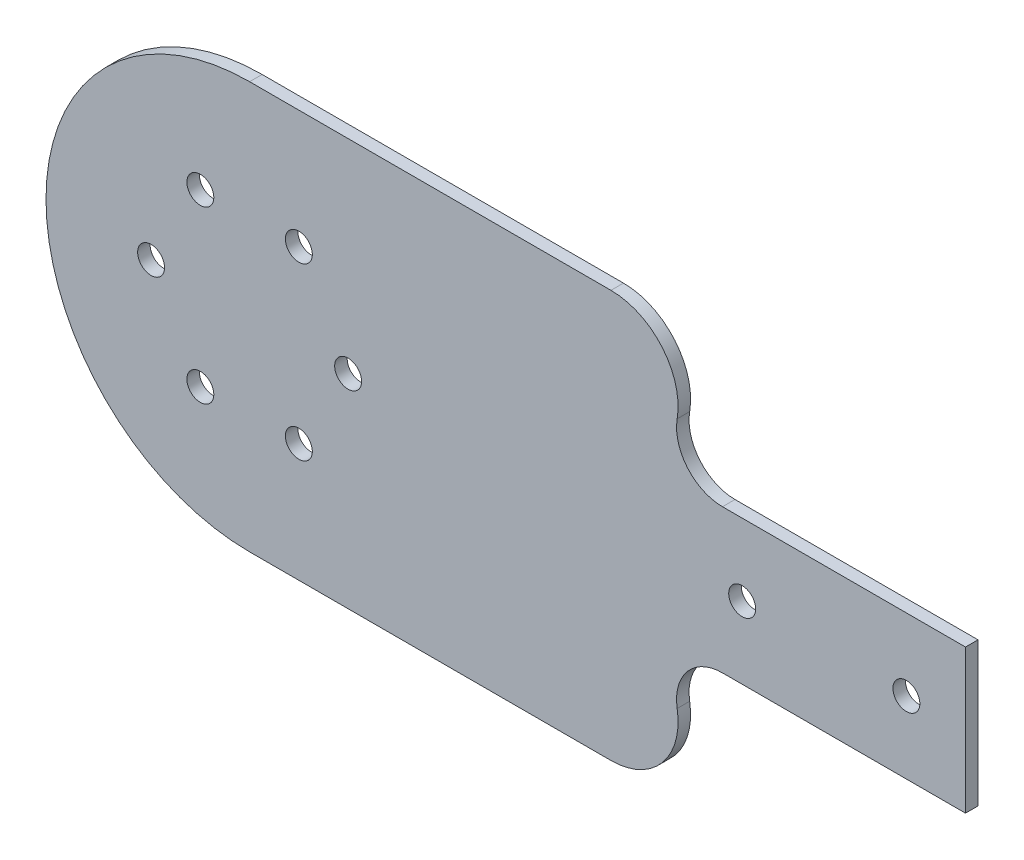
ISO-10303-21;
HEADER;
FILE_DESCRIPTION(('STEP AP214'),'2;1');
FILE_NAME('part.step','',(''),(''),'','','');
FILE_SCHEMA(('AUTOMOTIVE_DESIGN { 1 0 10303 214 1 1 1 1 }'));
ENDSEC;
DATA;
#1=APPLICATION_CONTEXT('core data for automotive mechanical design processes');
#2=APPLICATION_PROTOCOL_DEFINITION('international standard','automotive_design',2000,#1);
#3=PRODUCT_CONTEXT('',#1,'mechanical');
#4=PRODUCT('Part','Part','',(#3));
#5=PRODUCT_RELATED_PRODUCT_CATEGORY('part','',(#4));
#6=PRODUCT_DEFINITION_FORMATION('','',#4);
#7=PRODUCT_DEFINITION_CONTEXT('part definition',#1,'design');
#8=PRODUCT_DEFINITION('design','',#6,#7);
#9=PRODUCT_DEFINITION_SHAPE('','',#8);
#10=(LENGTH_UNIT() NAMED_UNIT(*) SI_UNIT(.MILLI.,.METRE.));
#11=(NAMED_UNIT(*) PLANE_ANGLE_UNIT() SI_UNIT($,.RADIAN.));
#12=(NAMED_UNIT(*) SI_UNIT($,.STERADIAN.) SOLID_ANGLE_UNIT());
#13=UNCERTAINTY_MEASURE_WITH_UNIT(LENGTH_MEASURE(1.E-05),#10,'distance_accuracy_value','');
#14=(GEOMETRIC_REPRESENTATION_CONTEXT(3) GLOBAL_UNCERTAINTY_ASSIGNED_CONTEXT((#13)) GLOBAL_UNIT_ASSIGNED_CONTEXT((#10,
#11,#12)) REPRESENTATION_CONTEXT('',''));
#15=CARTESIAN_POINT('',(0.,0.,0.));
#16=DIRECTION('',(0.,0.,1.));
#17=DIRECTION('',(1.,0.,0.));
#18=AXIS2_PLACEMENT_3D('',#15,#16,#17);
#19=CARTESIAN_POINT('',(0.,0.,1.905));
#20=DIRECTION('',(0.,0.,-1.));
#21=DIRECTION('',(-1.,0.,0.));
#22=AXIS2_PLACEMENT_3D('',#19,#20,#21);
#23=CYLINDRICAL_SURFACE('',#22,31.);
#24=CARTESIAN_POINT('',(0.,0.,0.));
#25=DIRECTION('',(0.,0.,1.));
#26=DIRECTION('',(-1.,0.,0.));
#27=AXIS2_PLACEMENT_3D('',#24,#25,#26);
#28=CIRCLE('',#27,31.);
#29=CARTESIAN_POINT('',(0.,31.,0.));
#30=VERTEX_POINT('',#29);
#31=CARTESIAN_POINT('',(0.,-31.,0.));
#32=VERTEX_POINT('',#31);
#33=EDGE_CURVE('E158',#30,#32,#28,.T.);
#34=ORIENTED_EDGE('',*,*,#33,.T.);
#35=DIRECTION('',(0.,0.,-1.));
#36=VECTOR('',#35,1.);
#37=CARTESIAN_POINT('',(0.,-31.,1.905));
#38=LINE('',#37,#36);
#39=CARTESIAN_POINT('',(0.,-31.,1.905));
#40=VERTEX_POINT('',#39);
#41=EDGE_CURVE('E11',#40,#32,#38,.T.);
#42=ORIENTED_EDGE('',*,*,#41,.F.);
#43=CARTESIAN_POINT('',(0.,0.,1.905));
#44=DIRECTION('',(0.,0.,1.));
#45=DIRECTION('',(-1.,0.,0.));
#46=AXIS2_PLACEMENT_3D('',#43,#44,#45);
#47=CIRCLE('',#46,31.);
#48=CARTESIAN_POINT('',(0.,31.,1.905));
#49=VERTEX_POINT('',#48);
#50=EDGE_CURVE('E190',#49,#40,#47,.T.);
#51=ORIENTED_EDGE('',*,*,#50,.F.);
#52=DIRECTION('',(0.,0.,-1.));
#53=VECTOR('',#52,1.);
#54=CARTESIAN_POINT('',(0.,31.,1.905));
#55=LINE('',#54,#53);
#56=EDGE_CURVE('E152',#49,#30,#55,.T.);
#57=ORIENTED_EDGE('',*,*,#56,.T.);
#58=EDGE_LOOP('',(#34,#42,#51,#57));
#59=FACE_BOUND('',#58,.T.);
#60=ADVANCED_FACE('F44',(#59),#23,.T.);
#61=CARTESIAN_POINT('',(0.,-31.,1.905));
#62=DIRECTION('',(0.,1.,0.));
#63=DIRECTION('',(-1.,0.,0.));
#64=AXIS2_PLACEMENT_3D('',#61,#62,#63);
#65=PLANE('',#64);
#66=DIRECTION('',(1.,0.,0.));
#67=VECTOR('',#66,1.);
#68=CARTESIAN_POINT('',(0.,-31.,0.));
#69=LINE('',#68,#67);
#70=CARTESIAN_POINT('',(55.02,-31.,0.));
#71=VERTEX_POINT('',#70);
#72=EDGE_CURVE('E165',#32,#71,#69,.T.);
#73=ORIENTED_EDGE('',*,*,#72,.T.);
#74=DIRECTION('',(0.,0.,-1.));
#75=VECTOR('',#74,1.);
#76=CARTESIAN_POINT('',(55.02,-31.,1.905));
#77=LINE('',#76,#75);
#78=CARTESIAN_POINT('',(55.02,-31.,1.905));
#79=VERTEX_POINT('',#78);
#80=EDGE_CURVE('E53',#79,#71,#77,.T.);
#81=ORIENTED_EDGE('',*,*,#80,.F.);
#82=DIRECTION('',(1.,0.,0.));
#83=VECTOR('',#82,1.);
#84=CARTESIAN_POINT('',(0.,-31.,1.905));
#85=LINE('',#84,#83);
#86=EDGE_CURVE('E112',#40,#79,#85,.T.);
#87=ORIENTED_EDGE('',*,*,#86,.F.);
#88=ORIENTED_EDGE('',*,*,#41,.T.);
#89=EDGE_LOOP('',(#73,#81,#87,#88));
#90=FACE_BOUND('',#89,.T.);
#91=ADVANCED_FACE('F358',(#90),#65,.F.);
#92=CARTESIAN_POINT('',(55.02,-20.7786788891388,1.905));
#93=DIRECTION('',(0.,0.,-1.));
#94=DIRECTION('',(-1.,0.,0.));
#95=AXIS2_PLACEMENT_3D('',#92,#93,#94);
#96=CYLINDRICAL_SURFACE('',#95,10.2213211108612);
#97=CARTESIAN_POINT('',(55.02,-20.7786788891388,0.));
#98=DIRECTION('',(0.,0.,1.));
#99=DIRECTION('',(1.,0.,0.));
#100=AXIS2_PLACEMENT_3D('',#97,#98,#99);
#101=CIRCLE('',#100,10.2213211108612);
#102=CARTESIAN_POINT('',(65.1021843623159,-19.097916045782,0.));
#103=VERTEX_POINT('',#102);
#104=EDGE_CURVE('E167',#71,#103,#101,.T.);
#105=ORIENTED_EDGE('',*,*,#104,.T.);
#106=DIRECTION('',(0.,0.,-1.));
#107=VECTOR('',#106,1.);
#108=CARTESIAN_POINT('',(65.1021843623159,-19.097916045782,1.905));
#109=LINE('',#108,#107);
#110=CARTESIAN_POINT('',(65.1021843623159,-19.097916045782,1.905));
#111=VERTEX_POINT('',#110);
#112=EDGE_CURVE('E206',#111,#103,#109,.T.);
#113=ORIENTED_EDGE('',*,*,#112,.F.);
#114=CARTESIAN_POINT('',(55.02,-20.7786788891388,1.905));
#115=DIRECTION('',(0.,0.,1.));
#116=DIRECTION('',(1.,0.,0.));
#117=AXIS2_PLACEMENT_3D('',#114,#115,#116);
#118=CIRCLE('',#117,10.2213211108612);
#119=EDGE_CURVE('E216',#79,#111,#118,.T.);
#120=ORIENTED_EDGE('',*,*,#119,.F.);
#121=ORIENTED_EDGE('',*,*,#80,.T.);
#122=EDGE_LOOP('',(#105,#113,#120,#121));
#123=FACE_BOUND('',#122,.T.);
#124=ADVANCED_FACE('F212',(#123),#96,.T.);
#125=CARTESIAN_POINT('',(72.,-17.94800727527,1.905));
#126=DIRECTION('',(0.,0.,-1.));
#127=DIRECTION('',(-1.,0.,0.));
#128=AXIS2_PLACEMENT_3D('',#125,#126,#127);
#129=CYLINDRICAL_SURFACE('',#128,6.99300727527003);
#130=CARTESIAN_POINT('',(72.,-17.94800727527,0.));
#131=DIRECTION('',(0.,0.,-1.));
#132=DIRECTION('',(-1.,0.,0.));
#133=AXIS2_PLACEMENT_3D('',#130,#131,#132);
#134=CIRCLE('',#133,6.99300727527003);
#135=CARTESIAN_POINT('',(72.,-10.955,0.));
#136=VERTEX_POINT('',#135);
#137=EDGE_CURVE('E166',#103,#136,#134,.T.);
#138=ORIENTED_EDGE('',*,*,#137,.T.);
#139=DIRECTION('',(0.,0.,-1.));
#140=VECTOR('',#139,1.);
#141=CARTESIAN_POINT('',(72.,-10.955,1.905));
#142=LINE('',#141,#140);
#143=CARTESIAN_POINT('',(72.,-10.955,1.905));
#144=VERTEX_POINT('',#143);
#145=EDGE_CURVE('E205',#144,#136,#142,.T.);
#146=ORIENTED_EDGE('',*,*,#145,.F.);
#147=CARTESIAN_POINT('',(72.,-17.94800727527,1.905));
#148=DIRECTION('',(0.,0.,-1.));
#149=DIRECTION('',(-1.,0.,0.));
#150=AXIS2_PLACEMENT_3D('',#147,#148,#149);
#151=CIRCLE('',#150,6.99300727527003);
#152=EDGE_CURVE('E231',#111,#144,#151,.T.);
#153=ORIENTED_EDGE('',*,*,#152,.F.);
#154=ORIENTED_EDGE('',*,*,#112,.T.);
#155=EDGE_LOOP('',(#138,#146,#153,#154));
#156=FACE_BOUND('',#155,.T.);
#157=ADVANCED_FACE('F223',(#156),#129,.F.);
#158=CARTESIAN_POINT('',(72.,-10.955,1.905));
#159=DIRECTION('',(0.,1.,0.));
#160=DIRECTION('',(-1.,0.,0.));
#161=AXIS2_PLACEMENT_3D('',#158,#159,#160);
#162=PLANE('',#161);
#163=DIRECTION('',(1.,0.,0.));
#164=VECTOR('',#163,1.);
#165=CARTESIAN_POINT('',(72.,-10.955,0.));
#166=LINE('',#165,#164);
#167=CARTESIAN_POINT('',(109.,-10.955,0.));
#168=VERTEX_POINT('',#167);
#169=EDGE_CURVE('E175',#136,#168,#166,.T.);
#170=ORIENTED_EDGE('',*,*,#169,.T.);
#171=DIRECTION('',(0.,0.,-1.));
#172=VECTOR('',#171,1.);
#173=CARTESIAN_POINT('',(109.,-10.955,1.905));
#174=LINE('',#173,#172);
#175=CARTESIAN_POINT('',(109.,-10.955,1.905));
#176=VERTEX_POINT('',#175);
#177=EDGE_CURVE('E196',#176,#168,#174,.T.);
#178=ORIENTED_EDGE('',*,*,#177,.F.);
#179=DIRECTION('',(1.,0.,0.));
#180=VECTOR('',#179,1.);
#181=CARTESIAN_POINT('',(72.,-10.955,1.905));
#182=LINE('',#181,#180);
#183=EDGE_CURVE('E233',#144,#176,#182,.T.);
#184=ORIENTED_EDGE('',*,*,#183,.F.);
#185=ORIENTED_EDGE('',*,*,#145,.T.);
#186=EDGE_LOOP('',(#170,#178,#184,#185));
#187=FACE_BOUND('',#186,.T.);
#188=ADVANCED_FACE('F226',(#187),#162,.F.);
#189=CARTESIAN_POINT('',(109.,-10.955,1.905));
#190=DIRECTION('',(-1.,0.,0.));
#191=DIRECTION('',(0.,0.,1.));
#192=AXIS2_PLACEMENT_3D('',#189,#190,#191);
#193=PLANE('',#192);
#194=DIRECTION('',(0.,1.,0.));
#195=VECTOR('',#194,1.);
#196=CARTESIAN_POINT('',(109.,-10.955,0.));
#197=LINE('',#196,#195);
#198=CARTESIAN_POINT('',(109.,10.955,0.));
#199=VERTEX_POINT('',#198);
#200=EDGE_CURVE('E173',#168,#199,#197,.T.);
#201=ORIENTED_EDGE('',*,*,#200,.T.);
#202=DIRECTION('',(0.,0.,-1.));
#203=VECTOR('',#202,1.);
#204=CARTESIAN_POINT('',(109.,10.955,1.905));
#205=LINE('',#204,#203);
#206=CARTESIAN_POINT('',(109.,10.955,1.905));
#207=VERTEX_POINT('',#206);
#208=EDGE_CURVE('E195',#207,#199,#205,.T.);
#209=ORIENTED_EDGE('',*,*,#208,.F.);
#210=DIRECTION('',(0.,1.,0.));
#211=VECTOR('',#210,1.);
#212=CARTESIAN_POINT('',(109.,-10.955,1.905));
#213=LINE('',#212,#211);
#214=EDGE_CURVE('E235',#176,#207,#213,.T.);
#215=ORIENTED_EDGE('',*,*,#214,.F.);
#216=ORIENTED_EDGE('',*,*,#177,.T.);
#217=EDGE_LOOP('',(#201,#209,#215,#216));
#218=FACE_BOUND('',#217,.T.);
#219=ADVANCED_FACE('F366',(#218),#193,.F.);
#220=CARTESIAN_POINT('',(109.,10.955,1.905));
#221=DIRECTION('',(0.,-1.,0.));
#222=DIRECTION('',(1.,0.,0.));
#223=AXIS2_PLACEMENT_3D('',#220,#221,#222);
#224=PLANE('',#223);
#225=DIRECTION('',(-1.,0.,0.));
#226=VECTOR('',#225,1.);
#227=CARTESIAN_POINT('',(109.,10.955,0.));
#228=LINE('',#227,#226);
#229=CARTESIAN_POINT('',(72.,10.955,0.));
#230=VERTEX_POINT('',#229);
#231=EDGE_CURVE('E177',#199,#230,#228,.T.);
#232=ORIENTED_EDGE('',*,*,#231,.T.);
#233=DIRECTION('',(0.,0.,-1.));
#234=VECTOR('',#233,1.);
#235=CARTESIAN_POINT('',(72.,10.955,1.905));
#236=LINE('',#235,#234);
#237=CARTESIAN_POINT('',(72.,10.955,1.905));
#238=VERTEX_POINT('',#237);
#239=EDGE_CURVE('E150',#238,#230,#236,.T.);
#240=ORIENTED_EDGE('',*,*,#239,.F.);
#241=DIRECTION('',(-1.,0.,0.));
#242=VECTOR('',#241,1.);
#243=CARTESIAN_POINT('',(109.,10.955,1.905));
#244=LINE('',#243,#242);
#245=EDGE_CURVE('E138',#207,#238,#244,.T.);
#246=ORIENTED_EDGE('',*,*,#245,.F.);
#247=ORIENTED_EDGE('',*,*,#208,.T.);
#248=EDGE_LOOP('',(#232,#240,#246,#247));
#249=FACE_BOUND('',#248,.T.);
#250=ADVANCED_FACE('F364',(#249),#224,.F.);
#251=CARTESIAN_POINT('',(72.,17.94800727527,1.905));
#252=DIRECTION('',(0.,0.,-1.));
#253=DIRECTION('',(-1.,0.,0.));
#254=AXIS2_PLACEMENT_3D('',#251,#252,#253);
#255=CYLINDRICAL_SURFACE('',#254,6.99300727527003);
#256=CARTESIAN_POINT('',(72.,17.94800727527,0.));
#257=DIRECTION('',(0.,0.,-1.));
#258=DIRECTION('',(-1.,0.,0.));
#259=AXIS2_PLACEMENT_3D('',#256,#257,#258);
#260=CIRCLE('',#259,6.99300727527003);
#261=CARTESIAN_POINT('',(65.1021843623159,19.097916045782,0.));
#262=VERTEX_POINT('',#261);
#263=EDGE_CURVE('E144',#230,#262,#260,.T.);
#264=ORIENTED_EDGE('',*,*,#263,.T.);
#265=DIRECTION('',(0.,0.,-1.));
#266=VECTOR('',#265,1.);
#267=CARTESIAN_POINT('',(65.1021843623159,19.097916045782,1.905));
#268=LINE('',#267,#266);
#269=CARTESIAN_POINT('',(65.1021843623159,19.097916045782,1.905));
#270=VERTEX_POINT('',#269);
#271=EDGE_CURVE('E142',#270,#262,#268,.T.);
#272=ORIENTED_EDGE('',*,*,#271,.F.);
#273=CARTESIAN_POINT('',(72.,17.94800727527,1.905));
#274=DIRECTION('',(0.,0.,-1.));
#275=DIRECTION('',(-1.,0.,0.));
#276=AXIS2_PLACEMENT_3D('',#273,#274,#275);
#277=CIRCLE('',#276,6.99300727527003);
#278=EDGE_CURVE('E128',#238,#270,#277,.T.);
#279=ORIENTED_EDGE('',*,*,#278,.F.);
#280=ORIENTED_EDGE('',*,*,#239,.T.);
#281=EDGE_LOOP('',(#264,#272,#279,#280));
#282=FACE_BOUND('',#281,.T.);
#283=ADVANCED_FACE('F141',(#282),#255,.F.);
#284=CARTESIAN_POINT('',(55.02,20.7786788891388,1.905));
#285=DIRECTION('',(0.,0.,-1.));
#286=DIRECTION('',(-1.,0.,0.));
#287=AXIS2_PLACEMENT_3D('',#284,#285,#286);
#288=CYLINDRICAL_SURFACE('',#287,10.2213211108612);
#289=CARTESIAN_POINT('',(55.02,20.7786788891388,0.));
#290=DIRECTION('',(0.,0.,1.));
#291=DIRECTION('',(-1.,0.,0.));
#292=AXIS2_PLACEMENT_3D('',#289,#290,#291);
#293=CIRCLE('',#292,10.2213211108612);
#294=CARTESIAN_POINT('',(55.02,31.,0.));
#295=VERTEX_POINT('',#294);
#296=EDGE_CURVE('E100',#262,#295,#293,.T.);
#297=ORIENTED_EDGE('',*,*,#296,.T.);
#298=DIRECTION('',(0.,0.,-1.));
#299=VECTOR('',#298,1.);
#300=CARTESIAN_POINT('',(55.02,31.,1.905));
#301=LINE('',#300,#299);
#302=CARTESIAN_POINT('',(55.02,31.,1.905));
#303=VERTEX_POINT('',#302);
#304=EDGE_CURVE('E146',#303,#295,#301,.T.);
#305=ORIENTED_EDGE('',*,*,#304,.F.);
#306=CARTESIAN_POINT('',(55.02,20.7786788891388,1.905));
#307=DIRECTION('',(0.,0.,1.));
#308=DIRECTION('',(-1.,0.,0.));
#309=AXIS2_PLACEMENT_3D('',#306,#307,#308);
#310=CIRCLE('',#309,10.2213211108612);
#311=EDGE_CURVE('E131',#270,#303,#310,.T.);
#312=ORIENTED_EDGE('',*,*,#311,.F.);
#313=ORIENTED_EDGE('',*,*,#271,.T.);
#314=EDGE_LOOP('',(#297,#305,#312,#313));
#315=FACE_BOUND('',#314,.T.);
#316=ADVANCED_FACE('F147',(#315),#288,.T.);
#317=CARTESIAN_POINT('',(55.02,31.,1.905));
#318=DIRECTION('',(0.,-1.,0.));
#319=DIRECTION('',(0.,0.,-1.));
#320=AXIS2_PLACEMENT_3D('',#317,#318,#319);
#321=PLANE('',#320);
#322=DIRECTION('',(-1.,0.,0.));
#323=VECTOR('',#322,1.);
#324=CARTESIAN_POINT('',(55.02,31.,0.));
#325=LINE('',#324,#323);
#326=EDGE_CURVE('E103',#295,#30,#325,.T.);
#327=ORIENTED_EDGE('',*,*,#326,.T.);
#328=ORIENTED_EDGE('',*,*,#56,.F.);
#329=DIRECTION('',(-1.,0.,0.));
#330=VECTOR('',#329,1.);
#331=CARTESIAN_POINT('',(55.02,31.,1.905));
#332=LINE('',#331,#330);
#333=EDGE_CURVE('E65',#303,#49,#332,.T.);
#334=ORIENTED_EDGE('',*,*,#333,.F.);
#335=ORIENTED_EDGE('',*,*,#304,.T.);
#336=EDGE_LOOP('',(#327,#328,#334,#335));
#337=FACE_BOUND('',#336,.T.);
#338=ADVANCED_FACE('F322',(#337),#321,.F.);
#339=CARTESIAN_POINT('',(0.,0.,1.905));
#340=DIRECTION('',(0.,0.,-1.));
#341=DIRECTION('',(-1.,0.,0.));
#342=AXIS2_PLACEMENT_3D('',#339,#340,#341);
#343=PLANE('',#342);
#344=CARTESIAN_POINT('',(-15.,0.,1.905));
#345=DIRECTION('',(0.,0.,1.));
#346=DIRECTION('',(1.,0.,0.));
#347=AXIS2_PLACEMENT_3D('',#344,#345,#346);
#348=CIRCLE('',#347,2.05);
#349=CARTESIAN_POINT('',(-12.95,0.,1.905));
#350=VERTEX_POINT('',#349);
#351=EDGE_CURVE('E266',#350,#350,#348,.T.);
#352=ORIENTED_EDGE('',*,*,#351,.F.);
#353=EDGE_LOOP('',(#352));
#354=FACE_BOUND('',#353,.T.);
#355=CARTESIAN_POINT('',(75.,-1.02887962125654E-13,1.905));
#356=DIRECTION('',(0.,0.,1.));
#357=DIRECTION('',(1.,0.,0.));
#358=AXIS2_PLACEMENT_3D('',#355,#356,#357);
#359=CIRCLE('',#358,2.04999999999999);
#360=CARTESIAN_POINT('',(77.05,-1.02887962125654E-13,1.905));
#361=VERTEX_POINT('',#360);
#362=EDGE_CURVE('E289',#361,#361,#359,.T.);
#363=ORIENTED_EDGE('',*,*,#362,.F.);
#364=EDGE_LOOP('',(#363));
#365=FACE_BOUND('',#364,.T.);
#366=CARTESIAN_POINT('',(-7.50000000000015,-12.9903810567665,1.905));
#367=DIRECTION('',(0.,0.,1.));
#368=DIRECTION('',(1.,0.,0.));
#369=AXIS2_PLACEMENT_3D('',#366,#367,#368);
#370=CIRCLE('',#369,2.05);
#371=CARTESIAN_POINT('',(-5.45000000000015,-12.9903810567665,1.905));
#372=VERTEX_POINT('',#371);
#373=EDGE_CURVE('E293',#372,#372,#370,.T.);
#374=ORIENTED_EDGE('',*,*,#373,.F.);
#375=EDGE_LOOP('',(#374));
#376=FACE_BOUND('',#375,.T.);
#377=CARTESIAN_POINT('',(7.49999999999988,-12.9903810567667,1.905));
#378=DIRECTION('',(0.,0.,1.));
#379=DIRECTION('',(1.,0.,0.));
#380=AXIS2_PLACEMENT_3D('',#377,#378,#379);
#381=CIRCLE('',#380,2.05);
#382=CARTESIAN_POINT('',(9.54999999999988,-12.9903810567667,1.905));
#383=VERTEX_POINT('',#382);
#384=EDGE_CURVE('E275',#383,#383,#381,.T.);
#385=ORIENTED_EDGE('',*,*,#384,.F.);
#386=EDGE_LOOP('',(#385));
#387=FACE_BOUND('',#386,.T.);
#388=CARTESIAN_POINT('',(100.,-1.02907469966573E-13,1.905));
#389=DIRECTION('',(0.,0.,1.));
#390=DIRECTION('',(1.,0.,0.));
#391=AXIS2_PLACEMENT_3D('',#388,#389,#390);
#392=CIRCLE('',#391,2.04999999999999);
#393=CARTESIAN_POINT('',(102.05,-1.02907469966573E-13,1.905));
#394=VERTEX_POINT('',#393);
#395=EDGE_CURVE('E265',#394,#394,#392,.T.);
#396=ORIENTED_EDGE('',*,*,#395,.F.);
#397=EDGE_LOOP('',(#396));
#398=FACE_BOUND('',#397,.T.);
#399=CARTESIAN_POINT('',(-7.49999999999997,12.9903810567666,1.905));
#400=DIRECTION('',(0.,0.,1.));
#401=DIRECTION('',(1.,0.,0.));
#402=AXIS2_PLACEMENT_3D('',#399,#400,#401);
#403=CIRCLE('',#402,2.05);
#404=CARTESIAN_POINT('',(-5.44999999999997,12.9903810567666,1.905));
#405=VERTEX_POINT('',#404);
#406=EDGE_CURVE('E251',#405,#405,#403,.T.);
#407=ORIENTED_EDGE('',*,*,#406,.F.);
#408=EDGE_LOOP('',(#407));
#409=FACE_BOUND('',#408,.T.);
#410=CARTESIAN_POINT('',(7.50000000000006,12.9903810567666,1.905));
#411=DIRECTION('',(0.,0.,1.));
#412=DIRECTION('',(1.,0.,0.));
#413=AXIS2_PLACEMENT_3D('',#410,#411,#412);
#414=CIRCLE('',#413,2.05);
#415=CARTESIAN_POINT('',(9.55000000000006,12.9903810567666,1.905));
#416=VERTEX_POINT('',#415);
#417=EDGE_CURVE('E255',#416,#416,#414,.T.);
#418=ORIENTED_EDGE('',*,*,#417,.F.);
#419=EDGE_LOOP('',(#418));
#420=FACE_BOUND('',#419,.T.);
#421=CARTESIAN_POINT('',(15.,-1.02907469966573E-13,1.905));
#422=DIRECTION('',(0.,0.,1.));
#423=DIRECTION('',(1.,0.,0.));
#424=AXIS2_PLACEMENT_3D('',#421,#422,#423);
#425=CIRCLE('',#424,2.05);
#426=CARTESIAN_POINT('',(17.05,-1.02907469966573E-13,1.905));
#427=VERTEX_POINT('',#426);
#428=EDGE_CURVE('E271',#427,#427,#425,.T.);
#429=ORIENTED_EDGE('',*,*,#428,.F.);
#430=EDGE_LOOP('',(#429));
#431=FACE_BOUND('',#430,.T.);
#432=ORIENTED_EDGE('',*,*,#50,.T.);
#433=ORIENTED_EDGE('',*,*,#86,.T.);
#434=ORIENTED_EDGE('',*,*,#119,.T.);
#435=ORIENTED_EDGE('',*,*,#152,.T.);
#436=ORIENTED_EDGE('',*,*,#183,.T.);
#437=ORIENTED_EDGE('',*,*,#214,.T.);
#438=ORIENTED_EDGE('',*,*,#245,.T.);
#439=ORIENTED_EDGE('',*,*,#278,.T.);
#440=ORIENTED_EDGE('',*,*,#311,.T.);
#441=ORIENTED_EDGE('',*,*,#333,.T.);
#442=EDGE_LOOP('',(#432,#433,#434,#435,#436,#437,#438,#439,#440,#441));
#443=FACE_BOUND('',#442,.T.);
#444=ADVANCED_FACE('F135',(#354,#365,#376,#387,#398,#409,#420,#431,#443),#343,.F.);
#445=CARTESIAN_POINT('',(0.,0.,0.));
#446=DIRECTION('',(0.,0.,-1.));
#447=DIRECTION('',(-1.,0.,0.));
#448=AXIS2_PLACEMENT_3D('',#445,#446,#447);
#449=PLANE('',#448);
#450=CARTESIAN_POINT('',(-15.,0.,0.));
#451=DIRECTION('',(0.,0.,1.));
#452=DIRECTION('',(1.,0.,0.));
#453=AXIS2_PLACEMENT_3D('',#450,#451,#452);
#454=CIRCLE('',#453,2.05);
#455=CARTESIAN_POINT('',(-12.95,0.,0.));
#456=VERTEX_POINT('',#455);
#457=EDGE_CURVE('E162',#456,#456,#454,.T.);
#458=ORIENTED_EDGE('',*,*,#457,.T.);
#459=EDGE_LOOP('',(#458));
#460=FACE_BOUND('',#459,.T.);
#461=CARTESIAN_POINT('',(75.,-1.02887962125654E-13,0.));
#462=DIRECTION('',(0.,0.,1.));
#463=DIRECTION('',(1.,0.,0.));
#464=AXIS2_PLACEMENT_3D('',#461,#462,#463);
#465=CIRCLE('',#464,2.04999999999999);
#466=CARTESIAN_POINT('',(77.05,-1.02887962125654E-13,0.));
#467=VERTEX_POINT('',#466);
#468=EDGE_CURVE('E284',#467,#467,#465,.T.);
#469=ORIENTED_EDGE('',*,*,#468,.T.);
#470=EDGE_LOOP('',(#469));
#471=FACE_BOUND('',#470,.T.);
#472=CARTESIAN_POINT('',(-7.50000000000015,-12.9903810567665,0.));
#473=DIRECTION('',(0.,0.,1.));
#474=DIRECTION('',(1.,0.,0.));
#475=AXIS2_PLACEMENT_3D('',#472,#473,#474);
#476=CIRCLE('',#475,2.05);
#477=CARTESIAN_POINT('',(-5.45000000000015,-12.9903810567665,0.));
#478=VERTEX_POINT('',#477);
#479=EDGE_CURVE('E292',#478,#478,#476,.T.);
#480=ORIENTED_EDGE('',*,*,#479,.T.);
#481=EDGE_LOOP('',(#480));
#482=FACE_BOUND('',#481,.T.);
#483=CARTESIAN_POINT('',(7.49999999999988,-12.9903810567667,0.));
#484=DIRECTION('',(0.,0.,1.));
#485=DIRECTION('',(1.,0.,0.));
#486=AXIS2_PLACEMENT_3D('',#483,#484,#485);
#487=CIRCLE('',#486,2.05);
#488=CARTESIAN_POINT('',(9.54999999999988,-12.9903810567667,0.));
#489=VERTEX_POINT('',#488);
#490=EDGE_CURVE('E296',#489,#489,#487,.T.);
#491=ORIENTED_EDGE('',*,*,#490,.T.);
#492=EDGE_LOOP('',(#491));
#493=FACE_BOUND('',#492,.T.);
#494=CARTESIAN_POINT('',(100.,-1.02907469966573E-13,0.));
#495=DIRECTION('',(0.,0.,1.));
#496=DIRECTION('',(1.,0.,0.));
#497=AXIS2_PLACEMENT_3D('',#494,#495,#496);
#498=CIRCLE('',#497,2.04999999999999);
#499=CARTESIAN_POINT('',(102.05,-1.02907469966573E-13,0.));
#500=VERTEX_POINT('',#499);
#501=EDGE_CURVE('E256',#500,#500,#498,.T.);
#502=ORIENTED_EDGE('',*,*,#501,.T.);
#503=EDGE_LOOP('',(#502));
#504=FACE_BOUND('',#503,.T.);
#505=CARTESIAN_POINT('',(-7.49999999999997,12.9903810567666,0.));
#506=DIRECTION('',(0.,0.,1.));
#507=DIRECTION('',(1.,0.,0.));
#508=AXIS2_PLACEMENT_3D('',#505,#506,#507);
#509=CIRCLE('',#508,2.05);
#510=CARTESIAN_POINT('',(-5.44999999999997,12.9903810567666,0.));
#511=VERTEX_POINT('',#510);
#512=EDGE_CURVE('E250',#511,#511,#509,.T.);
#513=ORIENTED_EDGE('',*,*,#512,.T.);
#514=EDGE_LOOP('',(#513));
#515=FACE_BOUND('',#514,.T.);
#516=CARTESIAN_POINT('',(7.50000000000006,12.9903810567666,0.));
#517=DIRECTION('',(0.,0.,1.));
#518=DIRECTION('',(1.,0.,0.));
#519=AXIS2_PLACEMENT_3D('',#516,#517,#518);
#520=CIRCLE('',#519,2.05);
#521=CARTESIAN_POINT('',(9.55000000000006,12.9903810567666,0.));
#522=VERTEX_POINT('',#521);
#523=EDGE_CURVE('E277',#522,#522,#520,.T.);
#524=ORIENTED_EDGE('',*,*,#523,.T.);
#525=EDGE_LOOP('',(#524));
#526=FACE_BOUND('',#525,.T.);
#527=CARTESIAN_POINT('',(15.,-1.02907469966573E-13,0.));
#528=DIRECTION('',(0.,0.,1.));
#529=DIRECTION('',(1.,0.,0.));
#530=AXIS2_PLACEMENT_3D('',#527,#528,#529);
#531=CIRCLE('',#530,2.05);
#532=CARTESIAN_POINT('',(17.05,-1.02907469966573E-13,0.));
#533=VERTEX_POINT('',#532);
#534=EDGE_CURVE('E270',#533,#533,#531,.T.);
#535=ORIENTED_EDGE('',*,*,#534,.T.);
#536=EDGE_LOOP('',(#535));
#537=FACE_BOUND('',#536,.T.);
#538=ORIENTED_EDGE('',*,*,#33,.F.);
#539=ORIENTED_EDGE('',*,*,#326,.F.);
#540=ORIENTED_EDGE('',*,*,#296,.F.);
#541=ORIENTED_EDGE('',*,*,#263,.F.);
#542=ORIENTED_EDGE('',*,*,#231,.F.);
#543=ORIENTED_EDGE('',*,*,#200,.F.);
#544=ORIENTED_EDGE('',*,*,#169,.F.);
#545=ORIENTED_EDGE('',*,*,#137,.F.);
#546=ORIENTED_EDGE('',*,*,#104,.F.);
#547=ORIENTED_EDGE('',*,*,#72,.F.);
#548=EDGE_LOOP('',(#538,#539,#540,#541,#542,#543,#544,#545,#546,#547));
#549=FACE_BOUND('',#548,.T.);
#550=ADVANCED_FACE('F219',(#460,#471,#482,#493,#504,#515,#526,#537,#549),#449,.T.);
#551=CARTESIAN_POINT('',(15.,-1.02907469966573E-13,0.));
#552=DIRECTION('',(0.,0.,1.));
#553=DIRECTION('',(1.,0.,0.));
#554=AXIS2_PLACEMENT_3D('',#551,#552,#553);
#555=CYLINDRICAL_SURFACE('',#554,2.05);
#556=CARTESIAN_POINT('',(17.05,-1.02907469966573E-13,0.));
#557=CARTESIAN_POINT('',(17.05,-1.02907469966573E-13,0.01984375));
#558=CARTESIAN_POINT('',(17.05,-1.02907469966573E-13,0.0396875));
#559=CARTESIAN_POINT('',(17.05,-1.02907469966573E-13,0.079375));
#560=CARTESIAN_POINT('',(17.05,-1.02907469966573E-13,0.09921875));
#561=CARTESIAN_POINT('',(17.05,-1.02907469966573E-13,0.13890625));
#562=CARTESIAN_POINT('',(17.05,-1.02907469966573E-13,0.15875));
#563=CARTESIAN_POINT('',(17.05,-1.02907469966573E-13,0.1984375));
#564=CARTESIAN_POINT('',(17.05,-1.02907469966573E-13,0.21828125));
#565=CARTESIAN_POINT('',(17.05,-1.02907469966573E-13,0.25796875));
#566=CARTESIAN_POINT('',(17.05,-1.02907469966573E-13,0.2778125));
#567=CARTESIAN_POINT('',(17.05,-1.02907469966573E-13,0.3175));
#568=CARTESIAN_POINT('',(17.05,-1.02907469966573E-13,0.33734375));
#569=CARTESIAN_POINT('',(17.05,-1.02907469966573E-13,0.37703125));
#570=CARTESIAN_POINT('',(17.05,-1.02907469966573E-13,0.396875));
#571=CARTESIAN_POINT('',(17.05,-1.02907469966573E-13,0.4365625));
#572=CARTESIAN_POINT('',(17.05,-1.02907469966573E-13,0.45640625));
#573=CARTESIAN_POINT('',(17.05,-1.02907469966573E-13,0.49609375));
#574=CARTESIAN_POINT('',(17.05,-1.02907469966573E-13,0.5159375));
#575=CARTESIAN_POINT('',(17.05,-1.02907469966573E-13,0.555625));
#576=CARTESIAN_POINT('',(17.05,-1.02907469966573E-13,0.57546875));
#577=CARTESIAN_POINT('',(17.05,-1.02907469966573E-13,0.61515625));
#578=CARTESIAN_POINT('',(17.05,-1.02907469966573E-13,0.635));
#579=CARTESIAN_POINT('',(17.05,-1.02907469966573E-13,0.6746875));
#580=CARTESIAN_POINT('',(17.05,-1.02907469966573E-13,0.69453125));
#581=CARTESIAN_POINT('',(17.05,-1.02907469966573E-13,0.73421875));
#582=CARTESIAN_POINT('',(17.05,-1.02907469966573E-13,0.7540625));
#583=CARTESIAN_POINT('',(17.05,-1.02907469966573E-13,0.79375));
#584=CARTESIAN_POINT('',(17.05,-1.02907469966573E-13,0.81359375));
#585=CARTESIAN_POINT('',(17.05,-1.02907469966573E-13,0.85328125));
#586=CARTESIAN_POINT('',(17.05,-1.02907469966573E-13,0.873125));
#587=CARTESIAN_POINT('',(17.05,-1.02907469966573E-13,0.9128125));
#588=CARTESIAN_POINT('',(17.05,-1.02907469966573E-13,0.93265625));
#589=CARTESIAN_POINT('',(17.05,-1.02907469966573E-13,0.97234375));
#590=CARTESIAN_POINT('',(17.05,-1.02907469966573E-13,0.9921875));
#591=CARTESIAN_POINT('',(17.05,-1.02907469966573E-13,1.031875));
#592=CARTESIAN_POINT('',(17.05,-1.02907469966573E-13,1.05171875));
#593=CARTESIAN_POINT('',(17.05,-1.02907469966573E-13,1.09140625));
#594=CARTESIAN_POINT('',(17.05,-1.02907469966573E-13,1.11125));
#595=CARTESIAN_POINT('',(17.05,-1.02907469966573E-13,1.1509375));
#596=CARTESIAN_POINT('',(17.05,-1.02907469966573E-13,1.17078125));
#597=CARTESIAN_POINT('',(17.05,-1.02907469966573E-13,1.21046875));
#598=CARTESIAN_POINT('',(17.05,-1.02907469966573E-13,1.2303125));
#599=CARTESIAN_POINT('',(17.05,-1.02907469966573E-13,1.27));
#600=CARTESIAN_POINT('',(17.05,-1.02907469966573E-13,1.28984375));
#601=CARTESIAN_POINT('',(17.05,-1.02907469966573E-13,1.32953125));
#602=CARTESIAN_POINT('',(17.05,-1.02907469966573E-13,1.349375));
#603=CARTESIAN_POINT('',(17.05,-1.02907469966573E-13,1.3890625));
#604=CARTESIAN_POINT('',(17.05,-1.02907469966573E-13,1.40890625));
#605=CARTESIAN_POINT('',(17.05,-1.02907469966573E-13,1.44859375));
#606=CARTESIAN_POINT('',(17.05,-1.02907469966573E-13,1.4684375));
#607=CARTESIAN_POINT('',(17.05,-1.02907469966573E-13,1.508125));
#608=CARTESIAN_POINT('',(17.05,-1.02907469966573E-13,1.52796875));
#609=CARTESIAN_POINT('',(17.05,-1.02907469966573E-13,1.56765625));
#610=CARTESIAN_POINT('',(17.05,-1.02907469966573E-13,1.5875));
#611=CARTESIAN_POINT('',(17.05,-1.02907469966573E-13,1.6271875));
#612=CARTESIAN_POINT('',(17.05,-1.02907469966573E-13,1.64703125));
#613=CARTESIAN_POINT('',(17.05,-1.02907469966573E-13,1.68671875));
#614=CARTESIAN_POINT('',(17.05,-1.02907469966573E-13,1.7065625));
#615=CARTESIAN_POINT('',(17.05,-1.02907469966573E-13,1.74625));
#616=CARTESIAN_POINT('',(17.05,-1.02907469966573E-13,1.76609375));
#617=CARTESIAN_POINT('',(17.05,-1.02907469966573E-13,1.80578125));
#618=CARTESIAN_POINT('',(17.05,-1.02907469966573E-13,1.825625));
#619=CARTESIAN_POINT('',(17.05,-1.02907469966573E-13,1.8653125));
#620=CARTESIAN_POINT('',(17.05,-1.02907469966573E-13,1.88515625));
#621=CARTESIAN_POINT('',(17.05,-1.02907469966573E-13,1.905));
#622=B_SPLINE_CURVE_WITH_KNOTS('',3,(#556,#557,#558,#559,#560,#561,#562,#563,#564,#565,#566,
#567,#568,#569,#570,#571,#572,#573,#574,#575,#576,#577,#578,#579,#580,#581,#582,#583,#584,#585,
#586,#587,#588,#589,#590,#591,#592,#593,#594,#595,#596,#597,#598,#599,#600,#601,#602,#603,#604,
#605,#606,#607,#608,#609,#610,#611,#612,#613,#614,#615,#616,#617,#618,#619,#620,#621),
.UNSPECIFIED.,.F.,.F.,(4,2,2,2,2,2,2,2,2,2,2,2,2,2,2,2,2,2,2,2,2,2,2,2,2,2,2,2,2,2,2,2,4),(0.,
0.05953125,0.1190625,0.17859375,0.238125,0.29765625,0.3571875,0.41671875,0.47625,0.53578125,
0.5953125,0.65484375,0.714375,0.77390625,0.8334375,0.89296875,0.9525,1.01203125,1.0715625,
1.13109375,1.190625,1.25015625,1.3096875,1.36921875,1.42875,1.48828125,1.5478125,1.60734375,
1.666875,1.72640625,1.7859375,1.84546875,1.905),.UNSPECIFIED.);
#623=EDGE_CURVE('BSEAM338',#533,#427,#622,.T.);
#624=ORIENTED_EDGE('',*,*,#534,.F.);
#625=ORIENTED_EDGE('',*,*,#428,.T.);
#626=ORIENTED_EDGE('',*,*,#623,.T.);
#627=ORIENTED_EDGE('',*,*,#623,.F.);
#628=EDGE_LOOP('',(#624,#626,#625,#627));
#629=FACE_BOUND('',#628,.T.);
#630=ADVANCED_FACE('F338',(#629),#555,.F.);
#631=CARTESIAN_POINT('',(7.50000000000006,12.9903810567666,0.));
#632=DIRECTION('',(0.,0.,1.));
#633=DIRECTION('',(1.,0.,0.));
#634=AXIS2_PLACEMENT_3D('',#631,#632,#633);
#635=CYLINDRICAL_SURFACE('',#634,2.05);
#636=CARTESIAN_POINT('',(9.55000000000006,12.9903810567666,0.));
#637=CARTESIAN_POINT('',(9.55000000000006,12.9903810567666,0.01984375));
#638=CARTESIAN_POINT('',(9.55000000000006,12.9903810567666,0.0396875));
#639=CARTESIAN_POINT('',(9.55000000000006,12.9903810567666,0.079375));
#640=CARTESIAN_POINT('',(9.55000000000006,12.9903810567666,0.09921875));
#641=CARTESIAN_POINT('',(9.55000000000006,12.9903810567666,0.13890625));
#642=CARTESIAN_POINT('',(9.55000000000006,12.9903810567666,0.15875));
#643=CARTESIAN_POINT('',(9.55000000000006,12.9903810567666,0.1984375));
#644=CARTESIAN_POINT('',(9.55000000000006,12.9903810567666,0.21828125));
#645=CARTESIAN_POINT('',(9.55000000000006,12.9903810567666,0.25796875));
#646=CARTESIAN_POINT('',(9.55000000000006,12.9903810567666,0.2778125));
#647=CARTESIAN_POINT('',(9.55000000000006,12.9903810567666,0.3175));
#648=CARTESIAN_POINT('',(9.55000000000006,12.9903810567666,0.33734375));
#649=CARTESIAN_POINT('',(9.55000000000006,12.9903810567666,0.37703125));
#650=CARTESIAN_POINT('',(9.55000000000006,12.9903810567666,0.396875));
#651=CARTESIAN_POINT('',(9.55000000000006,12.9903810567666,0.4365625));
#652=CARTESIAN_POINT('',(9.55000000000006,12.9903810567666,0.45640625));
#653=CARTESIAN_POINT('',(9.55000000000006,12.9903810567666,0.49609375));
#654=CARTESIAN_POINT('',(9.55000000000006,12.9903810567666,0.5159375));
#655=CARTESIAN_POINT('',(9.55000000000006,12.9903810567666,0.555625));
#656=CARTESIAN_POINT('',(9.55000000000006,12.9903810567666,0.57546875));
#657=CARTESIAN_POINT('',(9.55000000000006,12.9903810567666,0.61515625));
#658=CARTESIAN_POINT('',(9.55000000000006,12.9903810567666,0.635));
#659=CARTESIAN_POINT('',(9.55000000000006,12.9903810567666,0.6746875));
#660=CARTESIAN_POINT('',(9.55000000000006,12.9903810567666,0.69453125));
#661=CARTESIAN_POINT('',(9.55000000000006,12.9903810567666,0.73421875));
#662=CARTESIAN_POINT('',(9.55000000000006,12.9903810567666,0.7540625));
#663=CARTESIAN_POINT('',(9.55000000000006,12.9903810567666,0.79375));
#664=CARTESIAN_POINT('',(9.55000000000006,12.9903810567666,0.81359375));
#665=CARTESIAN_POINT('',(9.55000000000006,12.9903810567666,0.85328125));
#666=CARTESIAN_POINT('',(9.55000000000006,12.9903810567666,0.873125));
#667=CARTESIAN_POINT('',(9.55000000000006,12.9903810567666,0.9128125));
#668=CARTESIAN_POINT('',(9.55000000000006,12.9903810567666,0.93265625));
#669=CARTESIAN_POINT('',(9.55000000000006,12.9903810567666,0.97234375));
#670=CARTESIAN_POINT('',(9.55000000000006,12.9903810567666,0.9921875));
#671=CARTESIAN_POINT('',(9.55000000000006,12.9903810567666,1.031875));
#672=CARTESIAN_POINT('',(9.55000000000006,12.9903810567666,1.05171875));
#673=CARTESIAN_POINT('',(9.55000000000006,12.9903810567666,1.09140625));
#674=CARTESIAN_POINT('',(9.55000000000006,12.9903810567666,1.11125));
#675=CARTESIAN_POINT('',(9.55000000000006,12.9903810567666,1.1509375));
#676=CARTESIAN_POINT('',(9.55000000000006,12.9903810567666,1.17078125));
#677=CARTESIAN_POINT('',(9.55000000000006,12.9903810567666,1.21046875));
#678=CARTESIAN_POINT('',(9.55000000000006,12.9903810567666,1.2303125));
#679=CARTESIAN_POINT('',(9.55000000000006,12.9903810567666,1.27));
#680=CARTESIAN_POINT('',(9.55000000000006,12.9903810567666,1.28984375));
#681=CARTESIAN_POINT('',(9.55000000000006,12.9903810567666,1.32953125));
#682=CARTESIAN_POINT('',(9.55000000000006,12.9903810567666,1.349375));
#683=CARTESIAN_POINT('',(9.55000000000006,12.9903810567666,1.3890625));
#684=CARTESIAN_POINT('',(9.55000000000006,12.9903810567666,1.40890625));
#685=CARTESIAN_POINT('',(9.55000000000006,12.9903810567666,1.44859375));
#686=CARTESIAN_POINT('',(9.55000000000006,12.9903810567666,1.4684375));
#687=CARTESIAN_POINT('',(9.55000000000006,12.9903810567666,1.508125));
#688=CARTESIAN_POINT('',(9.55000000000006,12.9903810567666,1.52796875));
#689=CARTESIAN_POINT('',(9.55000000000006,12.9903810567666,1.56765625));
#690=CARTESIAN_POINT('',(9.55000000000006,12.9903810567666,1.5875));
#691=CARTESIAN_POINT('',(9.55000000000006,12.9903810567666,1.6271875));
#692=CARTESIAN_POINT('',(9.55000000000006,12.9903810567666,1.64703125));
#693=CARTESIAN_POINT('',(9.55000000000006,12.9903810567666,1.68671875));
#694=CARTESIAN_POINT('',(9.55000000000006,12.9903810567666,1.7065625));
#695=CARTESIAN_POINT('',(9.55000000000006,12.9903810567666,1.74625));
#696=CARTESIAN_POINT('',(9.55000000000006,12.9903810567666,1.76609375));
#697=CARTESIAN_POINT('',(9.55000000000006,12.9903810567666,1.80578125));
#698=CARTESIAN_POINT('',(9.55000000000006,12.9903810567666,1.825625));
#699=CARTESIAN_POINT('',(9.55000000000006,12.9903810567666,1.8653125));
#700=CARTESIAN_POINT('',(9.55000000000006,12.9903810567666,1.88515625));
#701=CARTESIAN_POINT('',(9.55000000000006,12.9903810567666,1.905));
#702=B_SPLINE_CURVE_WITH_KNOTS('',3,(#636,#637,#638,#639,#640,#641,#642,#643,#644,#645,#646,
#647,#648,#649,#650,#651,#652,#653,#654,#655,#656,#657,#658,#659,#660,#661,#662,#663,#664,#665,
#666,#667,#668,#669,#670,#671,#672,#673,#674,#675,#676,#677,#678,#679,#680,#681,#682,#683,#684,
#685,#686,#687,#688,#689,#690,#691,#692,#693,#694,#695,#696,#697,#698,#699,#700,#701),
.UNSPECIFIED.,.F.,.F.,(4,2,2,2,2,2,2,2,2,2,2,2,2,2,2,2,2,2,2,2,2,2,2,2,2,2,2,2,2,2,2,2,4),(0.,
0.05953125,0.1190625,0.17859375,0.238125,0.29765625,0.3571875,0.41671875,0.47625,0.53578125,
0.5953125,0.65484375,0.714375,0.77390625,0.8334375,0.89296875,0.9525,1.01203125,1.0715625,
1.13109375,1.190625,1.25015625,1.3096875,1.36921875,1.42875,1.48828125,1.5478125,1.60734375,
1.666875,1.72640625,1.7859375,1.84546875,1.905),.UNSPECIFIED.);
#703=EDGE_CURVE('BSEAM344',#522,#416,#702,.T.);
#704=ORIENTED_EDGE('',*,*,#523,.F.);
#705=ORIENTED_EDGE('',*,*,#417,.T.);
#706=ORIENTED_EDGE('',*,*,#703,.T.);
#707=ORIENTED_EDGE('',*,*,#703,.F.);
#708=EDGE_LOOP('',(#704,#706,#705,#707));
#709=FACE_BOUND('',#708,.T.);
#710=ADVANCED_FACE('F344',(#709),#635,.F.);
#711=CARTESIAN_POINT('',(-7.49999999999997,12.9903810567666,0.));
#712=DIRECTION('',(0.,0.,1.));
#713=DIRECTION('',(1.,0.,0.));
#714=AXIS2_PLACEMENT_3D('',#711,#712,#713);
#715=CYLINDRICAL_SURFACE('',#714,2.05);
#716=CARTESIAN_POINT('',(-5.44999999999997,12.9903810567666,0.));
#717=CARTESIAN_POINT('',(-5.44999999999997,12.9903810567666,0.01984375));
#718=CARTESIAN_POINT('',(-5.44999999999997,12.9903810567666,0.0396875));
#719=CARTESIAN_POINT('',(-5.44999999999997,12.9903810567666,0.079375));
#720=CARTESIAN_POINT('',(-5.44999999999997,12.9903810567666,0.09921875));
#721=CARTESIAN_POINT('',(-5.44999999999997,12.9903810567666,0.13890625));
#722=CARTESIAN_POINT('',(-5.44999999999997,12.9903810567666,0.15875));
#723=CARTESIAN_POINT('',(-5.44999999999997,12.9903810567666,0.1984375));
#724=CARTESIAN_POINT('',(-5.44999999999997,12.9903810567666,0.21828125));
#725=CARTESIAN_POINT('',(-5.44999999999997,12.9903810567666,0.25796875));
#726=CARTESIAN_POINT('',(-5.44999999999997,12.9903810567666,0.2778125));
#727=CARTESIAN_POINT('',(-5.44999999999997,12.9903810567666,0.3175));
#728=CARTESIAN_POINT('',(-5.44999999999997,12.9903810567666,0.33734375));
#729=CARTESIAN_POINT('',(-5.44999999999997,12.9903810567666,0.37703125));
#730=CARTESIAN_POINT('',(-5.44999999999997,12.9903810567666,0.396875));
#731=CARTESIAN_POINT('',(-5.44999999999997,12.9903810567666,0.4365625));
#732=CARTESIAN_POINT('',(-5.44999999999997,12.9903810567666,0.45640625));
#733=CARTESIAN_POINT('',(-5.44999999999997,12.9903810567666,0.49609375));
#734=CARTESIAN_POINT('',(-5.44999999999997,12.9903810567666,0.5159375));
#735=CARTESIAN_POINT('',(-5.44999999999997,12.9903810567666,0.555625));
#736=CARTESIAN_POINT('',(-5.44999999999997,12.9903810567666,0.57546875));
#737=CARTESIAN_POINT('',(-5.44999999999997,12.9903810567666,0.61515625));
#738=CARTESIAN_POINT('',(-5.44999999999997,12.9903810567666,0.635));
#739=CARTESIAN_POINT('',(-5.44999999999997,12.9903810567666,0.6746875));
#740=CARTESIAN_POINT('',(-5.44999999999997,12.9903810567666,0.69453125));
#741=CARTESIAN_POINT('',(-5.44999999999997,12.9903810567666,0.73421875));
#742=CARTESIAN_POINT('',(-5.44999999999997,12.9903810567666,0.7540625));
#743=CARTESIAN_POINT('',(-5.44999999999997,12.9903810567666,0.79375));
#744=CARTESIAN_POINT('',(-5.44999999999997,12.9903810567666,0.81359375));
#745=CARTESIAN_POINT('',(-5.44999999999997,12.9903810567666,0.85328125));
#746=CARTESIAN_POINT('',(-5.44999999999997,12.9903810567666,0.873125));
#747=CARTESIAN_POINT('',(-5.44999999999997,12.9903810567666,0.9128125));
#748=CARTESIAN_POINT('',(-5.44999999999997,12.9903810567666,0.93265625));
#749=CARTESIAN_POINT('',(-5.44999999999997,12.9903810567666,0.97234375));
#750=CARTESIAN_POINT('',(-5.44999999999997,12.9903810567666,0.9921875));
#751=CARTESIAN_POINT('',(-5.44999999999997,12.9903810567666,1.031875));
#752=CARTESIAN_POINT('',(-5.44999999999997,12.9903810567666,1.05171875));
#753=CARTESIAN_POINT('',(-5.44999999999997,12.9903810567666,1.09140625));
#754=CARTESIAN_POINT('',(-5.44999999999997,12.9903810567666,1.11125));
#755=CARTESIAN_POINT('',(-5.44999999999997,12.9903810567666,1.1509375));
#756=CARTESIAN_POINT('',(-5.44999999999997,12.9903810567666,1.17078125));
#757=CARTESIAN_POINT('',(-5.44999999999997,12.9903810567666,1.21046875));
#758=CARTESIAN_POINT('',(-5.44999999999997,12.9903810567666,1.2303125));
#759=CARTESIAN_POINT('',(-5.44999999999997,12.9903810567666,1.27));
#760=CARTESIAN_POINT('',(-5.44999999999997,12.9903810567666,1.28984375));
#761=CARTESIAN_POINT('',(-5.44999999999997,12.9903810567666,1.32953125));
#762=CARTESIAN_POINT('',(-5.44999999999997,12.9903810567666,1.349375));
#763=CARTESIAN_POINT('',(-5.44999999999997,12.9903810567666,1.3890625));
#764=CARTESIAN_POINT('',(-5.44999999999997,12.9903810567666,1.40890625));
#765=CARTESIAN_POINT('',(-5.44999999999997,12.9903810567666,1.44859375));
#766=CARTESIAN_POINT('',(-5.44999999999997,12.9903810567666,1.4684375));
#767=CARTESIAN_POINT('',(-5.44999999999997,12.9903810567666,1.508125));
#768=CARTESIAN_POINT('',(-5.44999999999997,12.9903810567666,1.52796875));
#769=CARTESIAN_POINT('',(-5.44999999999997,12.9903810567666,1.56765625));
#770=CARTESIAN_POINT('',(-5.44999999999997,12.9903810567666,1.5875));
#771=CARTESIAN_POINT('',(-5.44999999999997,12.9903810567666,1.6271875));
#772=CARTESIAN_POINT('',(-5.44999999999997,12.9903810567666,1.64703125));
#773=CARTESIAN_POINT('',(-5.44999999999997,12.9903810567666,1.68671875));
#774=CARTESIAN_POINT('',(-5.44999999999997,12.9903810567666,1.7065625));
#775=CARTESIAN_POINT('',(-5.44999999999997,12.9903810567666,1.74625));
#776=CARTESIAN_POINT('',(-5.44999999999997,12.9903810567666,1.76609375));
#777=CARTESIAN_POINT('',(-5.44999999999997,12.9903810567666,1.80578125));
#778=CARTESIAN_POINT('',(-5.44999999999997,12.9903810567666,1.825625));
#779=CARTESIAN_POINT('',(-5.44999999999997,12.9903810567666,1.8653125));
#780=CARTESIAN_POINT('',(-5.44999999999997,12.9903810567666,1.88515625));
#781=CARTESIAN_POINT('',(-5.44999999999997,12.9903810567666,1.905));
#782=B_SPLINE_CURVE_WITH_KNOTS('',3,(#716,#717,#718,#719,#720,#721,#722,#723,#724,#725,#726,
#727,#728,#729,#730,#731,#732,#733,#734,#735,#736,#737,#738,#739,#740,#741,#742,#743,#744,#745,
#746,#747,#748,#749,#750,#751,#752,#753,#754,#755,#756,#757,#758,#759,#760,#761,#762,#763,#764,
#765,#766,#767,#768,#769,#770,#771,#772,#773,#774,#775,#776,#777,#778,#779,#780,#781),
.UNSPECIFIED.,.F.,.F.,(4,2,2,2,2,2,2,2,2,2,2,2,2,2,2,2,2,2,2,2,2,2,2,2,2,2,2,2,2,2,2,2,4),(0.,
0.05953125,0.1190625,0.17859375,0.238125,0.29765625,0.3571875,0.41671875,0.47625,0.53578125,
0.5953125,0.65484375,0.714375,0.77390625,0.8334375,0.89296875,0.9525,1.01203125,1.0715625,
1.13109375,1.190625,1.25015625,1.3096875,1.36921875,1.42875,1.48828125,1.5478125,1.60734375,
1.666875,1.72640625,1.7859375,1.84546875,1.905),.UNSPECIFIED.);
#783=EDGE_CURVE('BSEAM349',#511,#405,#782,.T.);
#784=ORIENTED_EDGE('',*,*,#512,.F.);
#785=ORIENTED_EDGE('',*,*,#406,.T.);
#786=ORIENTED_EDGE('',*,*,#783,.T.);
#787=ORIENTED_EDGE('',*,*,#783,.F.);
#788=EDGE_LOOP('',(#784,#786,#785,#787));
#789=FACE_BOUND('',#788,.T.);
#790=ADVANCED_FACE('F349',(#789),#715,.F.);
#791=CARTESIAN_POINT('',(100.,-1.02907469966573E-13,0.));
#792=DIRECTION('',(0.,0.,1.));
#793=DIRECTION('',(1.,0.,0.));
#794=AXIS2_PLACEMENT_3D('',#791,#792,#793);
#795=CYLINDRICAL_SURFACE('',#794,2.04999999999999);
#796=CARTESIAN_POINT('',(102.05,-1.02907469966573E-13,0.));
#797=CARTESIAN_POINT('',(102.05,-1.02907469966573E-13,0.01984375));
#798=CARTESIAN_POINT('',(102.05,-1.02907469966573E-13,0.0396875));
#799=CARTESIAN_POINT('',(102.05,-1.02907469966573E-13,0.079375));
#800=CARTESIAN_POINT('',(102.05,-1.02907469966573E-13,0.09921875));
#801=CARTESIAN_POINT('',(102.05,-1.02907469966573E-13,0.13890625));
#802=CARTESIAN_POINT('',(102.05,-1.02907469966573E-13,0.15875));
#803=CARTESIAN_POINT('',(102.05,-1.02907469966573E-13,0.1984375));
#804=CARTESIAN_POINT('',(102.05,-1.02907469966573E-13,0.21828125));
#805=CARTESIAN_POINT('',(102.05,-1.02907469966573E-13,0.25796875));
#806=CARTESIAN_POINT('',(102.05,-1.02907469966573E-13,0.2778125));
#807=CARTESIAN_POINT('',(102.05,-1.02907469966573E-13,0.3175));
#808=CARTESIAN_POINT('',(102.05,-1.02907469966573E-13,0.33734375));
#809=CARTESIAN_POINT('',(102.05,-1.02907469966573E-13,0.37703125));
#810=CARTESIAN_POINT('',(102.05,-1.02907469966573E-13,0.396875));
#811=CARTESIAN_POINT('',(102.05,-1.02907469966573E-13,0.4365625));
#812=CARTESIAN_POINT('',(102.05,-1.02907469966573E-13,0.45640625));
#813=CARTESIAN_POINT('',(102.05,-1.02907469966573E-13,0.49609375));
#814=CARTESIAN_POINT('',(102.05,-1.02907469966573E-13,0.5159375));
#815=CARTESIAN_POINT('',(102.05,-1.02907469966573E-13,0.555625));
#816=CARTESIAN_POINT('',(102.05,-1.02907469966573E-13,0.57546875));
#817=CARTESIAN_POINT('',(102.05,-1.02907469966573E-13,0.61515625));
#818=CARTESIAN_POINT('',(102.05,-1.02907469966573E-13,0.635));
#819=CARTESIAN_POINT('',(102.05,-1.02907469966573E-13,0.6746875));
#820=CARTESIAN_POINT('',(102.05,-1.02907469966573E-13,0.69453125));
#821=CARTESIAN_POINT('',(102.05,-1.02907469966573E-13,0.73421875));
#822=CARTESIAN_POINT('',(102.05,-1.02907469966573E-13,0.7540625));
#823=CARTESIAN_POINT('',(102.05,-1.02907469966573E-13,0.79375));
#824=CARTESIAN_POINT('',(102.05,-1.02907469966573E-13,0.81359375));
#825=CARTESIAN_POINT('',(102.05,-1.02907469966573E-13,0.85328125));
#826=CARTESIAN_POINT('',(102.05,-1.02907469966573E-13,0.873125));
#827=CARTESIAN_POINT('',(102.05,-1.02907469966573E-13,0.9128125));
#828=CARTESIAN_POINT('',(102.05,-1.02907469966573E-13,0.93265625));
#829=CARTESIAN_POINT('',(102.05,-1.02907469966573E-13,0.97234375));
#830=CARTESIAN_POINT('',(102.05,-1.02907469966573E-13,0.9921875));
#831=CARTESIAN_POINT('',(102.05,-1.02907469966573E-13,1.031875));
#832=CARTESIAN_POINT('',(102.05,-1.02907469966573E-13,1.05171875));
#833=CARTESIAN_POINT('',(102.05,-1.02907469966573E-13,1.09140625));
#834=CARTESIAN_POINT('',(102.05,-1.02907469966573E-13,1.11125));
#835=CARTESIAN_POINT('',(102.05,-1.02907469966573E-13,1.1509375));
#836=CARTESIAN_POINT('',(102.05,-1.02907469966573E-13,1.17078125));
#837=CARTESIAN_POINT('',(102.05,-1.02907469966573E-13,1.21046875));
#838=CARTESIAN_POINT('',(102.05,-1.02907469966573E-13,1.2303125));
#839=CARTESIAN_POINT('',(102.05,-1.02907469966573E-13,1.27));
#840=CARTESIAN_POINT('',(102.05,-1.02907469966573E-13,1.28984375));
#841=CARTESIAN_POINT('',(102.05,-1.02907469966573E-13,1.32953125));
#842=CARTESIAN_POINT('',(102.05,-1.02907469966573E-13,1.349375));
#843=CARTESIAN_POINT('',(102.05,-1.02907469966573E-13,1.3890625));
#844=CARTESIAN_POINT('',(102.05,-1.02907469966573E-13,1.40890625));
#845=CARTESIAN_POINT('',(102.05,-1.02907469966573E-13,1.44859375));
#846=CARTESIAN_POINT('',(102.05,-1.02907469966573E-13,1.4684375));
#847=CARTESIAN_POINT('',(102.05,-1.02907469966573E-13,1.508125));
#848=CARTESIAN_POINT('',(102.05,-1.02907469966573E-13,1.52796875));
#849=CARTESIAN_POINT('',(102.05,-1.02907469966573E-13,1.56765625));
#850=CARTESIAN_POINT('',(102.05,-1.02907469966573E-13,1.5875));
#851=CARTESIAN_POINT('',(102.05,-1.02907469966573E-13,1.6271875));
#852=CARTESIAN_POINT('',(102.05,-1.02907469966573E-13,1.64703125));
#853=CARTESIAN_POINT('',(102.05,-1.02907469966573E-13,1.68671875));
#854=CARTESIAN_POINT('',(102.05,-1.02907469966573E-13,1.7065625));
#855=CARTESIAN_POINT('',(102.05,-1.02907469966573E-13,1.74625));
#856=CARTESIAN_POINT('',(102.05,-1.02907469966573E-13,1.76609375));
#857=CARTESIAN_POINT('',(102.05,-1.02907469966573E-13,1.80578125));
#858=CARTESIAN_POINT('',(102.05,-1.02907469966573E-13,1.825625));
#859=CARTESIAN_POINT('',(102.05,-1.02907469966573E-13,1.8653125));
#860=CARTESIAN_POINT('',(102.05,-1.02907469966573E-13,1.88515625));
#861=CARTESIAN_POINT('',(102.05,-1.02907469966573E-13,1.905));
#862=B_SPLINE_CURVE_WITH_KNOTS('',3,(#796,#797,#798,#799,#800,#801,#802,#803,#804,#805,#806,
#807,#808,#809,#810,#811,#812,#813,#814,#815,#816,#817,#818,#819,#820,#821,#822,#823,#824,#825,
#826,#827,#828,#829,#830,#831,#832,#833,#834,#835,#836,#837,#838,#839,#840,#841,#842,#843,#844,
#845,#846,#847,#848,#849,#850,#851,#852,#853,#854,#855,#856,#857,#858,#859,#860,#861),
.UNSPECIFIED.,.F.,.F.,(4,2,2,2,2,2,2,2,2,2,2,2,2,2,2,2,2,2,2,2,2,2,2,2,2,2,2,2,2,2,2,2,4),(0.,
0.05953125,0.1190625,0.17859375,0.238125,0.29765625,0.3571875,0.41671875,0.47625,0.53578125,
0.5953125,0.65484375,0.714375,0.77390625,0.8334375,0.89296875,0.9525,1.01203125,1.0715625,
1.13109375,1.190625,1.25015625,1.3096875,1.36921875,1.42875,1.48828125,1.5478125,1.60734375,
1.666875,1.72640625,1.7859375,1.84546875,1.905),.UNSPECIFIED.);
#863=EDGE_CURVE('BSEAM462',#500,#394,#862,.T.);
#864=ORIENTED_EDGE('',*,*,#501,.F.);
#865=ORIENTED_EDGE('',*,*,#395,.T.);
#866=ORIENTED_EDGE('',*,*,#863,.T.);
#867=ORIENTED_EDGE('',*,*,#863,.F.);
#868=EDGE_LOOP('',(#864,#866,#865,#867));
#869=FACE_BOUND('',#868,.T.);
#870=ADVANCED_FACE('F462',(#869),#795,.F.);
#871=CARTESIAN_POINT('',(7.49999999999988,-12.9903810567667,0.));
#872=DIRECTION('',(0.,0.,1.));
#873=DIRECTION('',(1.,0.,0.));
#874=AXIS2_PLACEMENT_3D('',#871,#872,#873);
#875=CYLINDRICAL_SURFACE('',#874,2.05);
#876=CARTESIAN_POINT('',(9.54999999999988,-12.9903810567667,0.));
#877=CARTESIAN_POINT('',(9.54999999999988,-12.9903810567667,0.01984375));
#878=CARTESIAN_POINT('',(9.54999999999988,-12.9903810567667,0.0396875));
#879=CARTESIAN_POINT('',(9.54999999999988,-12.9903810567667,0.079375));
#880=CARTESIAN_POINT('',(9.54999999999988,-12.9903810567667,0.09921875));
#881=CARTESIAN_POINT('',(9.54999999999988,-12.9903810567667,0.13890625));
#882=CARTESIAN_POINT('',(9.54999999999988,-12.9903810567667,0.15875));
#883=CARTESIAN_POINT('',(9.54999999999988,-12.9903810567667,0.1984375));
#884=CARTESIAN_POINT('',(9.54999999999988,-12.9903810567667,0.21828125));
#885=CARTESIAN_POINT('',(9.54999999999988,-12.9903810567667,0.25796875));
#886=CARTESIAN_POINT('',(9.54999999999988,-12.9903810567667,0.2778125));
#887=CARTESIAN_POINT('',(9.54999999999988,-12.9903810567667,0.3175));
#888=CARTESIAN_POINT('',(9.54999999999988,-12.9903810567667,0.33734375));
#889=CARTESIAN_POINT('',(9.54999999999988,-12.9903810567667,0.37703125));
#890=CARTESIAN_POINT('',(9.54999999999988,-12.9903810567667,0.396875));
#891=CARTESIAN_POINT('',(9.54999999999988,-12.9903810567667,0.4365625));
#892=CARTESIAN_POINT('',(9.54999999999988,-12.9903810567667,0.45640625));
#893=CARTESIAN_POINT('',(9.54999999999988,-12.9903810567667,0.49609375));
#894=CARTESIAN_POINT('',(9.54999999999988,-12.9903810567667,0.5159375));
#895=CARTESIAN_POINT('',(9.54999999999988,-12.9903810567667,0.555625));
#896=CARTESIAN_POINT('',(9.54999999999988,-12.9903810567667,0.57546875));
#897=CARTESIAN_POINT('',(9.54999999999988,-12.9903810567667,0.61515625));
#898=CARTESIAN_POINT('',(9.54999999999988,-12.9903810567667,0.635));
#899=CARTESIAN_POINT('',(9.54999999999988,-12.9903810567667,0.6746875));
#900=CARTESIAN_POINT('',(9.54999999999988,-12.9903810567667,0.69453125));
#901=CARTESIAN_POINT('',(9.54999999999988,-12.9903810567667,0.73421875));
#902=CARTESIAN_POINT('',(9.54999999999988,-12.9903810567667,0.7540625));
#903=CARTESIAN_POINT('',(9.54999999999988,-12.9903810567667,0.79375));
#904=CARTESIAN_POINT('',(9.54999999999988,-12.9903810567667,0.81359375));
#905=CARTESIAN_POINT('',(9.54999999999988,-12.9903810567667,0.85328125));
#906=CARTESIAN_POINT('',(9.54999999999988,-12.9903810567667,0.873125));
#907=CARTESIAN_POINT('',(9.54999999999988,-12.9903810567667,0.9128125));
#908=CARTESIAN_POINT('',(9.54999999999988,-12.9903810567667,0.93265625));
#909=CARTESIAN_POINT('',(9.54999999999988,-12.9903810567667,0.97234375));
#910=CARTESIAN_POINT('',(9.54999999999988,-12.9903810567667,0.9921875));
#911=CARTESIAN_POINT('',(9.54999999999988,-12.9903810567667,1.031875));
#912=CARTESIAN_POINT('',(9.54999999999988,-12.9903810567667,1.05171875));
#913=CARTESIAN_POINT('',(9.54999999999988,-12.9903810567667,1.09140625));
#914=CARTESIAN_POINT('',(9.54999999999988,-12.9903810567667,1.11125));
#915=CARTESIAN_POINT('',(9.54999999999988,-12.9903810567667,1.1509375));
#916=CARTESIAN_POINT('',(9.54999999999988,-12.9903810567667,1.17078125));
#917=CARTESIAN_POINT('',(9.54999999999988,-12.9903810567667,1.21046875));
#918=CARTESIAN_POINT('',(9.54999999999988,-12.9903810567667,1.2303125));
#919=CARTESIAN_POINT('',(9.54999999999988,-12.9903810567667,1.27));
#920=CARTESIAN_POINT('',(9.54999999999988,-12.9903810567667,1.28984375));
#921=CARTESIAN_POINT('',(9.54999999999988,-12.9903810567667,1.32953125));
#922=CARTESIAN_POINT('',(9.54999999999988,-12.9903810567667,1.349375));
#923=CARTESIAN_POINT('',(9.54999999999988,-12.9903810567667,1.3890625));
#924=CARTESIAN_POINT('',(9.54999999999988,-12.9903810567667,1.40890625));
#925=CARTESIAN_POINT('',(9.54999999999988,-12.9903810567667,1.44859375));
#926=CARTESIAN_POINT('',(9.54999999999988,-12.9903810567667,1.4684375));
#927=CARTESIAN_POINT('',(9.54999999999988,-12.9903810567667,1.508125));
#928=CARTESIAN_POINT('',(9.54999999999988,-12.9903810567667,1.52796875));
#929=CARTESIAN_POINT('',(9.54999999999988,-12.9903810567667,1.56765625));
#930=CARTESIAN_POINT('',(9.54999999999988,-12.9903810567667,1.5875));
#931=CARTESIAN_POINT('',(9.54999999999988,-12.9903810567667,1.6271875));
#932=CARTESIAN_POINT('',(9.54999999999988,-12.9903810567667,1.64703125));
#933=CARTESIAN_POINT('',(9.54999999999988,-12.9903810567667,1.68671875));
#934=CARTESIAN_POINT('',(9.54999999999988,-12.9903810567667,1.7065625));
#935=CARTESIAN_POINT('',(9.54999999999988,-12.9903810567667,1.74625));
#936=CARTESIAN_POINT('',(9.54999999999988,-12.9903810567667,1.76609375));
#937=CARTESIAN_POINT('',(9.54999999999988,-12.9903810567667,1.80578125));
#938=CARTESIAN_POINT('',(9.54999999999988,-12.9903810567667,1.825625));
#939=CARTESIAN_POINT('',(9.54999999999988,-12.9903810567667,1.8653125));
#940=CARTESIAN_POINT('',(9.54999999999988,-12.9903810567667,1.88515625));
#941=CARTESIAN_POINT('',(9.54999999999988,-12.9903810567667,1.905));
#942=B_SPLINE_CURVE_WITH_KNOTS('',3,(#876,#877,#878,#879,#880,#881,#882,#883,#884,#885,#886,
#887,#888,#889,#890,#891,#892,#893,#894,#895,#896,#897,#898,#899,#900,#901,#902,#903,#904,#905,
#906,#907,#908,#909,#910,#911,#912,#913,#914,#915,#916,#917,#918,#919,#920,#921,#922,#923,#924,
#925,#926,#927,#928,#929,#930,#931,#932,#933,#934,#935,#936,#937,#938,#939,#940,#941),
.UNSPECIFIED.,.F.,.F.,(4,2,2,2,2,2,2,2,2,2,2,2,2,2,2,2,2,2,2,2,2,2,2,2,2,2,2,2,2,2,2,2,4),(0.,
0.05953125,0.1190625,0.17859375,0.238125,0.29765625,0.3571875,0.41671875,0.47625,0.53578125,
0.5953125,0.65484375,0.714375,0.77390625,0.8334375,0.89296875,0.9525,1.01203125,1.0715625,
1.13109375,1.190625,1.25015625,1.3096875,1.36921875,1.42875,1.48828125,1.5478125,1.60734375,
1.666875,1.72640625,1.7859375,1.84546875,1.905),.UNSPECIFIED.);
#943=EDGE_CURVE('BSEAM473',#489,#383,#942,.T.);
#944=ORIENTED_EDGE('',*,*,#490,.F.);
#945=ORIENTED_EDGE('',*,*,#384,.T.);
#946=ORIENTED_EDGE('',*,*,#943,.T.);
#947=ORIENTED_EDGE('',*,*,#943,.F.);
#948=EDGE_LOOP('',(#944,#946,#945,#947));
#949=FACE_BOUND('',#948,.T.);
#950=ADVANCED_FACE('F473',(#949),#875,.F.);
#951=CARTESIAN_POINT('',(-7.50000000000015,-12.9903810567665,0.));
#952=DIRECTION('',(0.,0.,1.));
#953=DIRECTION('',(1.,0.,0.));
#954=AXIS2_PLACEMENT_3D('',#951,#952,#953);
#955=CYLINDRICAL_SURFACE('',#954,2.05);
#956=CARTESIAN_POINT('',(-5.45000000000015,-12.9903810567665,0.));
#957=CARTESIAN_POINT('',(-5.45000000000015,-12.9903810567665,0.01984375));
#958=CARTESIAN_POINT('',(-5.45000000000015,-12.9903810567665,0.0396875));
#959=CARTESIAN_POINT('',(-5.45000000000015,-12.9903810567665,0.079375));
#960=CARTESIAN_POINT('',(-5.45000000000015,-12.9903810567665,0.09921875));
#961=CARTESIAN_POINT('',(-5.45000000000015,-12.9903810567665,0.13890625));
#962=CARTESIAN_POINT('',(-5.45000000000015,-12.9903810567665,0.15875));
#963=CARTESIAN_POINT('',(-5.45000000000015,-12.9903810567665,0.1984375));
#964=CARTESIAN_POINT('',(-5.45000000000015,-12.9903810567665,0.21828125));
#965=CARTESIAN_POINT('',(-5.45000000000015,-12.9903810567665,0.25796875));
#966=CARTESIAN_POINT('',(-5.45000000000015,-12.9903810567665,0.2778125));
#967=CARTESIAN_POINT('',(-5.45000000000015,-12.9903810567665,0.3175));
#968=CARTESIAN_POINT('',(-5.45000000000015,-12.9903810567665,0.33734375));
#969=CARTESIAN_POINT('',(-5.45000000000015,-12.9903810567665,0.37703125));
#970=CARTESIAN_POINT('',(-5.45000000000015,-12.9903810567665,0.396875));
#971=CARTESIAN_POINT('',(-5.45000000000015,-12.9903810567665,0.4365625));
#972=CARTESIAN_POINT('',(-5.45000000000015,-12.9903810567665,0.45640625));
#973=CARTESIAN_POINT('',(-5.45000000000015,-12.9903810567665,0.49609375));
#974=CARTESIAN_POINT('',(-5.45000000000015,-12.9903810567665,0.5159375));
#975=CARTESIAN_POINT('',(-5.45000000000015,-12.9903810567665,0.555625));
#976=CARTESIAN_POINT('',(-5.45000000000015,-12.9903810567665,0.57546875));
#977=CARTESIAN_POINT('',(-5.45000000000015,-12.9903810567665,0.61515625));
#978=CARTESIAN_POINT('',(-5.45000000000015,-12.9903810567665,0.635));
#979=CARTESIAN_POINT('',(-5.45000000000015,-12.9903810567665,0.6746875));
#980=CARTESIAN_POINT('',(-5.45000000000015,-12.9903810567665,0.69453125));
#981=CARTESIAN_POINT('',(-5.45000000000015,-12.9903810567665,0.73421875));
#982=CARTESIAN_POINT('',(-5.45000000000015,-12.9903810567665,0.7540625));
#983=CARTESIAN_POINT('',(-5.45000000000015,-12.9903810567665,0.79375));
#984=CARTESIAN_POINT('',(-5.45000000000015,-12.9903810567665,0.81359375));
#985=CARTESIAN_POINT('',(-5.45000000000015,-12.9903810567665,0.85328125));
#986=CARTESIAN_POINT('',(-5.45000000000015,-12.9903810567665,0.873125));
#987=CARTESIAN_POINT('',(-5.45000000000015,-12.9903810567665,0.9128125));
#988=CARTESIAN_POINT('',(-5.45000000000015,-12.9903810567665,0.93265625));
#989=CARTESIAN_POINT('',(-5.45000000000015,-12.9903810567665,0.97234375));
#990=CARTESIAN_POINT('',(-5.45000000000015,-12.9903810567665,0.9921875));
#991=CARTESIAN_POINT('',(-5.45000000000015,-12.9903810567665,1.031875));
#992=CARTESIAN_POINT('',(-5.45000000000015,-12.9903810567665,1.05171875));
#993=CARTESIAN_POINT('',(-5.45000000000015,-12.9903810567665,1.09140625));
#994=CARTESIAN_POINT('',(-5.45000000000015,-12.9903810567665,1.11125));
#995=CARTESIAN_POINT('',(-5.45000000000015,-12.9903810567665,1.1509375));
#996=CARTESIAN_POINT('',(-5.45000000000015,-12.9903810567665,1.17078125));
#997=CARTESIAN_POINT('',(-5.45000000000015,-12.9903810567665,1.21046875));
#998=CARTESIAN_POINT('',(-5.45000000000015,-12.9903810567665,1.2303125));
#999=CARTESIAN_POINT('',(-5.45000000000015,-12.9903810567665,1.27));
#1000=CARTESIAN_POINT('',(-5.45000000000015,-12.9903810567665,1.28984375));
#1001=CARTESIAN_POINT('',(-5.45000000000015,-12.9903810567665,1.32953125));
#1002=CARTESIAN_POINT('',(-5.45000000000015,-12.9903810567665,1.349375));
#1003=CARTESIAN_POINT('',(-5.45000000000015,-12.9903810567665,1.3890625));
#1004=CARTESIAN_POINT('',(-5.45000000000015,-12.9903810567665,1.40890625));
#1005=CARTESIAN_POINT('',(-5.45000000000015,-12.9903810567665,1.44859375));
#1006=CARTESIAN_POINT('',(-5.45000000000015,-12.9903810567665,1.4684375));
#1007=CARTESIAN_POINT('',(-5.45000000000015,-12.9903810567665,1.508125));
#1008=CARTESIAN_POINT('',(-5.45000000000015,-12.9903810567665,1.52796875));
#1009=CARTESIAN_POINT('',(-5.45000000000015,-12.9903810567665,1.56765625));
#1010=CARTESIAN_POINT('',(-5.45000000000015,-12.9903810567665,1.5875));
#1011=CARTESIAN_POINT('',(-5.45000000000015,-12.9903810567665,1.6271875));
#1012=CARTESIAN_POINT('',(-5.45000000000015,-12.9903810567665,1.64703125));
#1013=CARTESIAN_POINT('',(-5.45000000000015,-12.9903810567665,1.68671875));
#1014=CARTESIAN_POINT('',(-5.45000000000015,-12.9903810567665,1.7065625));
#1015=CARTESIAN_POINT('',(-5.45000000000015,-12.9903810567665,1.74625));
#1016=CARTESIAN_POINT('',(-5.45000000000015,-12.9903810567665,1.76609375));
#1017=CARTESIAN_POINT('',(-5.45000000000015,-12.9903810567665,1.80578125));
#1018=CARTESIAN_POINT('',(-5.45000000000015,-12.9903810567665,1.825625));
#1019=CARTESIAN_POINT('',(-5.45000000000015,-12.9903810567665,1.8653125));
#1020=CARTESIAN_POINT('',(-5.45000000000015,-12.9903810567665,1.88515625));
#1021=CARTESIAN_POINT('',(-5.45000000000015,-12.9903810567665,1.905));
#1022=B_SPLINE_CURVE_WITH_KNOTS('',3,(#956,#957,#958,#959,#960,#961,#962,#963,#964,#965,#966,
#967,#968,#969,#970,#971,#972,#973,#974,#975,#976,#977,#978,#979,#980,#981,#982,#983,#984,#985,
#986,#987,#988,#989,#990,#991,#992,#993,#994,#995,#996,#997,#998,#999,#1000,#1001,#1002,#1003,
#1004,#1005,#1006,#1007,#1008,#1009,#1010,#1011,#1012,#1013,#1014,#1015,#1016,#1017,#1018,#1019,
#1020,#1021),.UNSPECIFIED.,.F.,.F.,(4,2,2,2,2,2,2,2,2,2,2,2,2,2,2,2,2,2,2,2,2,2,2,2,2,2,2,2,2,2,
2,2,4),(0.,0.05953125,0.1190625,0.17859375,0.238125,0.29765625,0.3571875,0.41671875,0.47625,
0.53578125,0.5953125,0.65484375,0.714375,0.77390625,0.8334375,0.89296875,0.9525,1.01203125,
1.0715625,1.13109375,1.190625,1.25015625,1.3096875,1.36921875,1.42875,1.48828125,1.5478125,
1.60734375,1.666875,1.72640625,1.7859375,1.84546875,1.905),.UNSPECIFIED.);
#1023=EDGE_CURVE('BSEAM477',#478,#372,#1022,.T.);
#1024=ORIENTED_EDGE('',*,*,#479,.F.);
#1025=ORIENTED_EDGE('',*,*,#373,.T.);
#1026=ORIENTED_EDGE('',*,*,#1023,.T.);
#1027=ORIENTED_EDGE('',*,*,#1023,.F.);
#1028=EDGE_LOOP('',(#1024,#1026,#1025,#1027));
#1029=FACE_BOUND('',#1028,.T.);
#1030=ADVANCED_FACE('F477',(#1029),#955,.F.);
#1031=CARTESIAN_POINT('',(75.,-1.02887962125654E-13,0.));
#1032=DIRECTION('',(0.,0.,1.));
#1033=DIRECTION('',(1.,0.,0.));
#1034=AXIS2_PLACEMENT_3D('',#1031,#1032,#1033);
#1035=CYLINDRICAL_SURFACE('',#1034,2.04999999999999);
#1036=CARTESIAN_POINT('',(77.05,-1.02887962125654E-13,0.));
#1037=CARTESIAN_POINT('',(77.05,-1.02887962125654E-13,0.01984375));
#1038=CARTESIAN_POINT('',(77.05,-1.02887962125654E-13,0.0396875));
#1039=CARTESIAN_POINT('',(77.05,-1.02887962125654E-13,0.079375));
#1040=CARTESIAN_POINT('',(77.05,-1.02887962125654E-13,0.09921875));
#1041=CARTESIAN_POINT('',(77.05,-1.02887962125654E-13,0.13890625));
#1042=CARTESIAN_POINT('',(77.05,-1.02887962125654E-13,0.15875));
#1043=CARTESIAN_POINT('',(77.05,-1.02887962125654E-13,0.1984375));
#1044=CARTESIAN_POINT('',(77.05,-1.02887962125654E-13,0.21828125));
#1045=CARTESIAN_POINT('',(77.05,-1.02887962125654E-13,0.25796875));
#1046=CARTESIAN_POINT('',(77.05,-1.02887962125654E-13,0.2778125));
#1047=CARTESIAN_POINT('',(77.05,-1.02887962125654E-13,0.3175));
#1048=CARTESIAN_POINT('',(77.05,-1.02887962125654E-13,0.33734375));
#1049=CARTESIAN_POINT('',(77.05,-1.02887962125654E-13,0.37703125));
#1050=CARTESIAN_POINT('',(77.05,-1.02887962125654E-13,0.396875));
#1051=CARTESIAN_POINT('',(77.05,-1.02887962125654E-13,0.4365625));
#1052=CARTESIAN_POINT('',(77.05,-1.02887962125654E-13,0.45640625));
#1053=CARTESIAN_POINT('',(77.05,-1.02887962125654E-13,0.49609375));
#1054=CARTESIAN_POINT('',(77.05,-1.02887962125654E-13,0.5159375));
#1055=CARTESIAN_POINT('',(77.05,-1.02887962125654E-13,0.555625));
#1056=CARTESIAN_POINT('',(77.05,-1.02887962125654E-13,0.57546875));
#1057=CARTESIAN_POINT('',(77.05,-1.02887962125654E-13,0.61515625));
#1058=CARTESIAN_POINT('',(77.05,-1.02887962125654E-13,0.635));
#1059=CARTESIAN_POINT('',(77.05,-1.02887962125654E-13,0.6746875));
#1060=CARTESIAN_POINT('',(77.05,-1.02887962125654E-13,0.69453125));
#1061=CARTESIAN_POINT('',(77.05,-1.02887962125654E-13,0.73421875));
#1062=CARTESIAN_POINT('',(77.05,-1.02887962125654E-13,0.7540625));
#1063=CARTESIAN_POINT('',(77.05,-1.02887962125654E-13,0.79375));
#1064=CARTESIAN_POINT('',(77.05,-1.02887962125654E-13,0.81359375));
#1065=CARTESIAN_POINT('',(77.05,-1.02887962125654E-13,0.85328125));
#1066=CARTESIAN_POINT('',(77.05,-1.02887962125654E-13,0.873125));
#1067=CARTESIAN_POINT('',(77.05,-1.02887962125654E-13,0.9128125));
#1068=CARTESIAN_POINT('',(77.05,-1.02887962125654E-13,0.93265625));
#1069=CARTESIAN_POINT('',(77.05,-1.02887962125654E-13,0.97234375));
#1070=CARTESIAN_POINT('',(77.05,-1.02887962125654E-13,0.9921875));
#1071=CARTESIAN_POINT('',(77.05,-1.02887962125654E-13,1.031875));
#1072=CARTESIAN_POINT('',(77.05,-1.02887962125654E-13,1.05171875));
#1073=CARTESIAN_POINT('',(77.05,-1.02887962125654E-13,1.09140625));
#1074=CARTESIAN_POINT('',(77.05,-1.02887962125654E-13,1.11125));
#1075=CARTESIAN_POINT('',(77.05,-1.02887962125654E-13,1.1509375));
#1076=CARTESIAN_POINT('',(77.05,-1.02887962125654E-13,1.17078125));
#1077=CARTESIAN_POINT('',(77.05,-1.02887962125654E-13,1.21046875));
#1078=CARTESIAN_POINT('',(77.05,-1.02887962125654E-13,1.2303125));
#1079=CARTESIAN_POINT('',(77.05,-1.02887962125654E-13,1.27));
#1080=CARTESIAN_POINT('',(77.05,-1.02887962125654E-13,1.28984375));
#1081=CARTESIAN_POINT('',(77.05,-1.02887962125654E-13,1.32953125));
#1082=CARTESIAN_POINT('',(77.05,-1.02887962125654E-13,1.349375));
#1083=CARTESIAN_POINT('',(77.05,-1.02887962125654E-13,1.3890625));
#1084=CARTESIAN_POINT('',(77.05,-1.02887962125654E-13,1.40890625));
#1085=CARTESIAN_POINT('',(77.05,-1.02887962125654E-13,1.44859375));
#1086=CARTESIAN_POINT('',(77.05,-1.02887962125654E-13,1.4684375));
#1087=CARTESIAN_POINT('',(77.05,-1.02887962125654E-13,1.508125));
#1088=CARTESIAN_POINT('',(77.05,-1.02887962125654E-13,1.52796875));
#1089=CARTESIAN_POINT('',(77.05,-1.02887962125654E-13,1.56765625));
#1090=CARTESIAN_POINT('',(77.05,-1.02887962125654E-13,1.5875));
#1091=CARTESIAN_POINT('',(77.05,-1.02887962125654E-13,1.6271875));
#1092=CARTESIAN_POINT('',(77.05,-1.02887962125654E-13,1.64703125));
#1093=CARTESIAN_POINT('',(77.05,-1.02887962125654E-13,1.68671875));
#1094=CARTESIAN_POINT('',(77.05,-1.02887962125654E-13,1.7065625));
#1095=CARTESIAN_POINT('',(77.05,-1.02887962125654E-13,1.74625));
#1096=CARTESIAN_POINT('',(77.05,-1.02887962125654E-13,1.76609375));
#1097=CARTESIAN_POINT('',(77.05,-1.02887962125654E-13,1.80578125));
#1098=CARTESIAN_POINT('',(77.05,-1.02887962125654E-13,1.825625));
#1099=CARTESIAN_POINT('',(77.05,-1.02887962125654E-13,1.8653125));
#1100=CARTESIAN_POINT('',(77.05,-1.02887962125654E-13,1.88515625));
#1101=CARTESIAN_POINT('',(77.05,-1.02887962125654E-13,1.905));
#1102=B_SPLINE_CURVE_WITH_KNOTS('',3,(#1036,#1037,#1038,#1039,#1040,#1041,#1042,#1043,#1044,
#1045,#1046,#1047,#1048,#1049,#1050,#1051,#1052,#1053,#1054,#1055,#1056,#1057,#1058,#1059,#1060,
#1061,#1062,#1063,#1064,#1065,#1066,#1067,#1068,#1069,#1070,#1071,#1072,#1073,#1074,#1075,#1076,
#1077,#1078,#1079,#1080,#1081,#1082,#1083,#1084,#1085,#1086,#1087,#1088,#1089,#1090,#1091,#1092,
#1093,#1094,#1095,#1096,#1097,#1098,#1099,#1100,#1101),.UNSPECIFIED.,.F.,.F.,(4,2,2,2,2,2,2,2,2,
2,2,2,2,2,2,2,2,2,2,2,2,2,2,2,2,2,2,2,2,2,2,2,4),(0.,0.05953125,0.1190625,0.17859375,0.238125,
0.29765625,0.3571875,0.41671875,0.47625,0.53578125,0.5953125,0.65484375,0.714375,0.77390625,
0.8334375,0.89296875,0.9525,1.01203125,1.0715625,1.13109375,1.190625,1.25015625,1.3096875,
1.36921875,1.42875,1.48828125,1.5478125,1.60734375,1.666875,1.72640625,1.7859375,1.84546875,
1.905),.UNSPECIFIED.);
#1103=EDGE_CURVE('BSEAM318',#467,#361,#1102,.T.);
#1104=ORIENTED_EDGE('',*,*,#468,.F.);
#1105=ORIENTED_EDGE('',*,*,#362,.T.);
#1106=ORIENTED_EDGE('',*,*,#1103,.T.);
#1107=ORIENTED_EDGE('',*,*,#1103,.F.);
#1108=EDGE_LOOP('',(#1104,#1106,#1105,#1107));
#1109=FACE_BOUND('',#1108,.T.);
#1110=ADVANCED_FACE('F318',(#1109),#1035,.F.);
#1111=CARTESIAN_POINT('',(-15.,0.,0.));
#1112=DIRECTION('',(0.,0.,1.));
#1113=DIRECTION('',(1.,0.,0.));
#1114=AXIS2_PLACEMENT_3D('',#1111,#1112,#1113);
#1115=CYLINDRICAL_SURFACE('',#1114,2.05);
#1116=CARTESIAN_POINT('',(-12.95,0.,0.));
#1117=CARTESIAN_POINT('',(-12.95,0.,0.01984375));
#1118=CARTESIAN_POINT('',(-12.95,0.,0.0396875));
#1119=CARTESIAN_POINT('',(-12.95,0.,0.079375));
#1120=CARTESIAN_POINT('',(-12.95,0.,0.09921875));
#1121=CARTESIAN_POINT('',(-12.95,0.,0.13890625));
#1122=CARTESIAN_POINT('',(-12.95,0.,0.15875));
#1123=CARTESIAN_POINT('',(-12.95,0.,0.1984375));
#1124=CARTESIAN_POINT('',(-12.95,0.,0.21828125));
#1125=CARTESIAN_POINT('',(-12.95,0.,0.25796875));
#1126=CARTESIAN_POINT('',(-12.95,0.,0.2778125));
#1127=CARTESIAN_POINT('',(-12.95,0.,0.3175));
#1128=CARTESIAN_POINT('',(-12.95,0.,0.33734375));
#1129=CARTESIAN_POINT('',(-12.95,0.,0.37703125));
#1130=CARTESIAN_POINT('',(-12.95,0.,0.396875));
#1131=CARTESIAN_POINT('',(-12.95,0.,0.4365625));
#1132=CARTESIAN_POINT('',(-12.95,0.,0.45640625));
#1133=CARTESIAN_POINT('',(-12.95,0.,0.49609375));
#1134=CARTESIAN_POINT('',(-12.95,0.,0.5159375));
#1135=CARTESIAN_POINT('',(-12.95,0.,0.555625));
#1136=CARTESIAN_POINT('',(-12.95,0.,0.57546875));
#1137=CARTESIAN_POINT('',(-12.95,0.,0.61515625));
#1138=CARTESIAN_POINT('',(-12.95,0.,0.635));
#1139=CARTESIAN_POINT('',(-12.95,0.,0.6746875));
#1140=CARTESIAN_POINT('',(-12.95,0.,0.69453125));
#1141=CARTESIAN_POINT('',(-12.95,0.,0.73421875));
#1142=CARTESIAN_POINT('',(-12.95,0.,0.7540625));
#1143=CARTESIAN_POINT('',(-12.95,0.,0.79375));
#1144=CARTESIAN_POINT('',(-12.95,0.,0.81359375));
#1145=CARTESIAN_POINT('',(-12.95,0.,0.85328125));
#1146=CARTESIAN_POINT('',(-12.95,0.,0.873125));
#1147=CARTESIAN_POINT('',(-12.95,0.,0.9128125));
#1148=CARTESIAN_POINT('',(-12.95,0.,0.93265625));
#1149=CARTESIAN_POINT('',(-12.95,0.,0.97234375));
#1150=CARTESIAN_POINT('',(-12.95,0.,0.9921875));
#1151=CARTESIAN_POINT('',(-12.95,0.,1.031875));
#1152=CARTESIAN_POINT('',(-12.95,0.,1.05171875));
#1153=CARTESIAN_POINT('',(-12.95,0.,1.09140625));
#1154=CARTESIAN_POINT('',(-12.95,0.,1.11125));
#1155=CARTESIAN_POINT('',(-12.95,0.,1.1509375));
#1156=CARTESIAN_POINT('',(-12.95,0.,1.17078125));
#1157=CARTESIAN_POINT('',(-12.95,0.,1.21046875));
#1158=CARTESIAN_POINT('',(-12.95,0.,1.2303125));
#1159=CARTESIAN_POINT('',(-12.95,0.,1.27));
#1160=CARTESIAN_POINT('',(-12.95,0.,1.28984375));
#1161=CARTESIAN_POINT('',(-12.95,0.,1.32953125));
#1162=CARTESIAN_POINT('',(-12.95,0.,1.349375));
#1163=CARTESIAN_POINT('',(-12.95,0.,1.3890625));
#1164=CARTESIAN_POINT('',(-12.95,0.,1.40890625));
#1165=CARTESIAN_POINT('',(-12.95,0.,1.44859375));
#1166=CARTESIAN_POINT('',(-12.95,0.,1.4684375));
#1167=CARTESIAN_POINT('',(-12.95,0.,1.508125));
#1168=CARTESIAN_POINT('',(-12.95,0.,1.52796875));
#1169=CARTESIAN_POINT('',(-12.95,0.,1.56765625));
#1170=CARTESIAN_POINT('',(-12.95,0.,1.5875));
#1171=CARTESIAN_POINT('',(-12.95,0.,1.6271875));
#1172=CARTESIAN_POINT('',(-12.95,0.,1.64703125));
#1173=CARTESIAN_POINT('',(-12.95,0.,1.68671875));
#1174=CARTESIAN_POINT('',(-12.95,0.,1.7065625));
#1175=CARTESIAN_POINT('',(-12.95,0.,1.74625));
#1176=CARTESIAN_POINT('',(-12.95,0.,1.76609375));
#1177=CARTESIAN_POINT('',(-12.95,0.,1.80578125));
#1178=CARTESIAN_POINT('',(-12.95,0.,1.825625));
#1179=CARTESIAN_POINT('',(-12.95,0.,1.8653125));
#1180=CARTESIAN_POINT('',(-12.95,0.,1.88515625));
#1181=CARTESIAN_POINT('',(-12.95,0.,1.905));
#1182=B_SPLINE_CURVE_WITH_KNOTS('',3,(#1116,#1117,#1118,#1119,#1120,#1121,#1122,#1123,#1124,
#1125,#1126,#1127,#1128,#1129,#1130,#1131,#1132,#1133,#1134,#1135,#1136,#1137,#1138,#1139,#1140,
#1141,#1142,#1143,#1144,#1145,#1146,#1147,#1148,#1149,#1150,#1151,#1152,#1153,#1154,#1155,#1156,
#1157,#1158,#1159,#1160,#1161,#1162,#1163,#1164,#1165,#1166,#1167,#1168,#1169,#1170,#1171,#1172,
#1173,#1174,#1175,#1176,#1177,#1178,#1179,#1180,#1181),.UNSPECIFIED.,.F.,.F.,(4,2,2,2,2,2,2,2,2,
2,2,2,2,2,2,2,2,2,2,2,2,2,2,2,2,2,2,2,2,2,2,2,4),(0.,0.05953125,0.1190625,0.17859375,0.238125,
0.29765625,0.3571875,0.41671875,0.47625,0.53578125,0.5953125,0.65484375,0.714375,0.77390625,
0.8334375,0.89296875,0.9525,1.01203125,1.0715625,1.13109375,1.190625,1.25015625,1.3096875,
1.36921875,1.42875,1.48828125,1.5478125,1.60734375,1.666875,1.72640625,1.7859375,1.84546875,
1.905),.UNSPECIFIED.);
#1183=EDGE_CURVE('BSEAM312',#456,#350,#1182,.T.);
#1184=ORIENTED_EDGE('',*,*,#457,.F.);
#1185=ORIENTED_EDGE('',*,*,#351,.T.);
#1186=ORIENTED_EDGE('',*,*,#1183,.T.);
#1187=ORIENTED_EDGE('',*,*,#1183,.F.);
#1188=EDGE_LOOP('',(#1184,#1186,#1185,#1187));
#1189=FACE_BOUND('',#1188,.T.);
#1190=ADVANCED_FACE('F312',(#1189),#1115,.F.);
#1191=CLOSED_SHELL('',(#60,#91,#124,#157,#188,#219,#250,#283,#316,#338,#444,#550,#630,#710,#790,
#870,#950,#1030,#1110,#1190));
#1192=MANIFOLD_SOLID_BREP('B2',#1191);
#1193=ADVANCED_BREP_SHAPE_REPRESENTATION('',(#18,#1192),#14);
#1194=SHAPE_DEFINITION_REPRESENTATION(#9,#1193);
ENDSEC;
END-ISO-10303-21;
